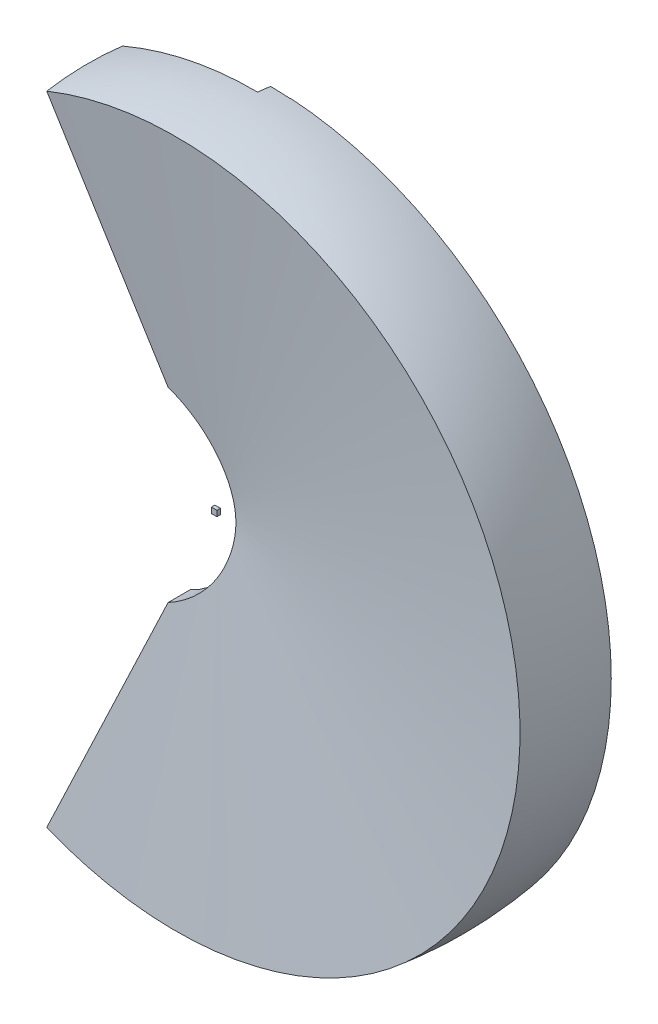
ISO-10303-21;
HEADER;
FILE_DESCRIPTION(('STEP AP214'),'2;1');
FILE_NAME('part.step','',(''),(''),'','','');
FILE_SCHEMA(('AUTOMOTIVE_DESIGN { 1 0 10303 214 1 1 1 1 }'));
ENDSEC;
DATA;
#1=APPLICATION_CONTEXT('core data for automotive mechanical design processes');
#2=APPLICATION_PROTOCOL_DEFINITION('international standard','automotive_design',2000,#1);
#3=PRODUCT_CONTEXT('',#1,'mechanical');
#4=PRODUCT('Part','Part','',(#3));
#5=PRODUCT_RELATED_PRODUCT_CATEGORY('part','',(#4));
#6=PRODUCT_DEFINITION_FORMATION('','',#4);
#7=PRODUCT_DEFINITION_CONTEXT('part definition',#1,'design');
#8=PRODUCT_DEFINITION('design','',#6,#7);
#9=PRODUCT_DEFINITION_SHAPE('','',#8);
#10=(LENGTH_UNIT() NAMED_UNIT(*) SI_UNIT(.MILLI.,.METRE.));
#11=(NAMED_UNIT(*) PLANE_ANGLE_UNIT() SI_UNIT($,.RADIAN.));
#12=(NAMED_UNIT(*) SI_UNIT($,.STERADIAN.) SOLID_ANGLE_UNIT());
#13=UNCERTAINTY_MEASURE_WITH_UNIT(LENGTH_MEASURE(1.E-05),#10,'distance_accuracy_value','');
#14=(GEOMETRIC_REPRESENTATION_CONTEXT(3) GLOBAL_UNCERTAINTY_ASSIGNED_CONTEXT((#13)) GLOBAL_UNIT_ASSIGNED_CONTEXT((#10,
#11,#12)) REPRESENTATION_CONTEXT('',''));
#15=CARTESIAN_POINT('',(0.,0.,0.));
#16=DIRECTION('',(0.,0.,1.));
#17=DIRECTION('',(1.,0.,0.));
#18=AXIS2_PLACEMENT_3D('',#15,#16,#17);
#19=CARTESIAN_POINT('',(0.,0.,-7.5));
#20=DIRECTION('',(0.,0.,1.));
#21=DIRECTION('',(1.,0.,0.));
#22=AXIS2_PLACEMENT_3D('',#19,#20,#21);
#23=SPHERICAL_SURFACE('',#22,4000.);
#24=CARTESIAN_POINT('',(0.,0.,-7.5));
#25=DIRECTION('',(0.997893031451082,-0.0648806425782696,0.));
#26=DIRECTION('',(0.0648806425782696,0.997893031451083,0.));
#27=AXIS2_PLACEMENT_3D('',#24,#25,#26);
#28=CIRCLE('',#27,4000.);
#29=CARTESIAN_POINT('',(256.858744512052,3950.60130464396,-579.140548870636));
#30=VERTEX_POINT('',#29);
#31=CARTESIAN_POINT('',(256.800723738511,3949.70891943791,-585.300000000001));
#32=VERTEX_POINT('',#31);
#33=EDGE_CURVE('E145',#30,#32,#28,.F.);
#34=ORIENTED_EDGE('',*,*,#33,.F.);
#35=CARTESIAN_POINT('',(-1.96086942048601E-12,0.,-579.140548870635));
#36=DIRECTION('',(0.,0.,1.));
#37=DIRECTION('',(1.,0.,0.));
#38=AXIS2_PLACEMENT_3D('',#35,#36,#37);
#39=CIRCLE('',#38,3958.94267234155);
#40=CARTESIAN_POINT('',(32.4999999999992,3958.80926957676,-579.140548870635));
#41=VERTEX_POINT('',#40);
#42=EDGE_CURVE('E182',#30,#41,#39,.T.);
#43=ORIENTED_EDGE('',*,*,#42,.T.);
#44=CARTESIAN_POINT('',(32.5,0.,-7.5));
#45=DIRECTION('',(-1.,0.,0.));
#46=DIRECTION('',(0.,-1.,0.));
#47=AXIS2_PLACEMENT_3D('',#44,#45,#46);
#48=CIRCLE('',#47,3999.8679665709);
#49=CARTESIAN_POINT('',(32.4999999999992,3977.58430490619,-429.124059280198));
#50=VERTEX_POINT('',#49);
#51=EDGE_CURVE('E304',#50,#41,#48,.T.);
#52=ORIENTED_EDGE('',*,*,#51,.F.);
#53=CARTESIAN_POINT('',(0.,-1.28889548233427E-05,-7.50012159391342));
#54=DIRECTION('',(0.,0.105409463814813,0.994428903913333));
#55=DIRECTION('',(0.,-0.994428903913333,0.105409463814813));
#56=AXIS2_PLACEMENT_3D('',#53,#54,#55);
#57=CIRCLE('',#56,4000.);
#58=CARTESIAN_POINT('',(-1495.43439657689,3689.27439106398,-398.563208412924));
#59=VERTEX_POINT('',#58);
#60=EDGE_CURVE('E325',#50,#59,#57,.T.);
#61=ORIENTED_EDGE('',*,*,#60,.T.);
#62=CARTESIAN_POINT('',(0.,0.,-7.5));
#63=DIRECTION('',(0.926758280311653,0.375658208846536,0.));
#64=DIRECTION('',(-0.375658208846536,0.926758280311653,0.));
#65=AXIS2_PLACEMENT_3D('',#62,#63,#64);
#66=CIRCLE('',#65,4000.);
#67=CARTESIAN_POINT('',(-1491.43243809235,3679.4014585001,479.977373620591));
#68=VERTEX_POINT('',#67);
#69=EDGE_CURVE('E172',#68,#59,#66,.F.);
#70=ORIENTED_EDGE('',*,*,#69,.F.);
#71=CARTESIAN_POINT('',(1.67216877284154E-12,0.,479.977373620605));
#72=DIRECTION('',(0.,0.,1.));
#73=DIRECTION('',(1.,0.,0.));
#74=AXIS2_PLACEMENT_3D('',#71,#72,#73);
#75=CIRCLE('',#74,3970.18460656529);
#76=CARTESIAN_POINT('',(-1491.43243809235,-3679.4014585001,479.977373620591));
#77=VERTEX_POINT('',#76);
#78=EDGE_CURVE('E167',#77,#68,#75,.T.);
#79=ORIENTED_EDGE('',*,*,#78,.F.);
#80=CARTESIAN_POINT('',(0.,0.,-7.5));
#81=DIRECTION('',(-0.926758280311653,0.375658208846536,0.));
#82=DIRECTION('',(-0.375658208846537,-0.926758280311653,0.));
#83=AXIS2_PLACEMENT_3D('',#80,#81,#82);
#84=CIRCLE('',#83,4000.);
#85=CARTESIAN_POINT('',(-1495.43440107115,-3689.27440215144,-398.563086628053));
#86=VERTEX_POINT('',#85);
#87=EDGE_CURVE('E310',#77,#86,#84,.F.);
#88=ORIENTED_EDGE('',*,*,#87,.T.);
#89=CARTESIAN_POINT('',(0.,0.,-7.50000000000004));
#90=DIRECTION('',(0.,-0.105409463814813,0.994428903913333));
#91=DIRECTION('',(0.,-0.994428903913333,-0.105409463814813));
#92=AXIS2_PLACEMENT_3D('',#89,#90,#91);
#93=CIRCLE('',#92,4000.);
#94=CARTESIAN_POINT('',(32.5000000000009,-3977.58431779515,-429.123937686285));
#95=VERTEX_POINT('',#94);
#96=EDGE_CURVE('E318',#86,#95,#93,.T.);
#97=ORIENTED_EDGE('',*,*,#96,.T.);
#98=CARTESIAN_POINT('',(32.5,0.,-7.5));
#99=DIRECTION('',(-1.,0.,0.));
#100=DIRECTION('',(0.,-1.,0.));
#101=AXIS2_PLACEMENT_3D('',#98,#99,#100);
#102=CIRCLE('',#101,3999.8679665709);
#103=CARTESIAN_POINT('',(32.5000000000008,-3958.80926957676,-579.140548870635));
#104=VERTEX_POINT('',#103);
#105=EDGE_CURVE('E323',#104,#95,#102,.T.);
#106=ORIENTED_EDGE('',*,*,#105,.F.);
#107=CARTESIAN_POINT('',(-1.96086942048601E-12,0.,-579.140548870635));
#108=DIRECTION('',(0.,0.,1.));
#109=DIRECTION('',(1.,0.,0.));
#110=AXIS2_PLACEMENT_3D('',#107,#108,#109);
#111=CIRCLE('',#110,3958.94267234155);
#112=CARTESIAN_POINT('',(256.858744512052,-3950.60130464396,-579.140548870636));
#113=VERTEX_POINT('',#112);
#114=EDGE_CURVE('E258',#104,#113,#111,.T.);
#115=ORIENTED_EDGE('',*,*,#114,.T.);
#116=CARTESIAN_POINT('',(0.,0.,-7.5));
#117=DIRECTION('',(0.997893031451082,0.0648806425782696,0.));
#118=DIRECTION('',(-0.0648806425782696,0.997893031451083,0.));
#119=AXIS2_PLACEMENT_3D('',#116,#117,#118);
#120=CIRCLE('',#119,4000.);
#121=CARTESIAN_POINT('',(256.800723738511,-3949.70891943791,-585.300000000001));
#122=VERTEX_POINT('',#121);
#123=EDGE_CURVE('E166',#122,#113,#120,.F.);
#124=ORIENTED_EDGE('',*,*,#123,.F.);
#125=CARTESIAN_POINT('',(-1.98199787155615E-12,0.,-585.299999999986));
#126=DIRECTION('',(0.,0.,1.));
#127=DIRECTION('',(1.,0.,0.));
#128=AXIS2_PLACEMENT_3D('',#125,#126,#127);
#129=CIRCLE('',#128,3958.04840293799);
#130=EDGE_CURVE('E159',#122,#32,#129,.T.);
#131=ORIENTED_EDGE('',*,*,#130,.T.);
#132=EDGE_LOOP('',(#34,#43,#52,#61,#70,#79,#88,#97,#106,#115,#124,#131));
#133=FACE_BOUND('',#132,.T.);
#134=ADVANCED_FACE('F46',(#133),#23,.T.);
#135=CARTESIAN_POINT('',(32.5,0.,0.));
#136=DIRECTION('',(-1.,0.,0.));
#137=DIRECTION('',(0.,-1.,0.));
#138=AXIS2_PLACEMENT_3D('',#135,#136,#137);
#139=PLANE('',#138);
#140=ORIENTED_EDGE('',*,*,#51,.T.);
#141=CARTESIAN_POINT('',(32.4999999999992,3977.58500490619,-581.95720431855));
#142=CARTESIAN_POINT('',(32.4999999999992,3894.73332832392,-569.528149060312));
#143=CARTESIAN_POINT('',(32.4999999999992,3811.88164810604,-557.099118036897));
#144=CARTESIAN_POINT('',(32.4999999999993,3646.17827953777,-532.241117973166));
#145=CARTESIAN_POINT('',(32.4999999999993,3563.32659118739,-519.812148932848));
#146=CARTESIAN_POINT('',(32.4999999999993,3397.62326066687,-494.954294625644));
#147=CARTESIAN_POINT('',(32.4999999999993,3314.77161849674,-482.525409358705));
#148=CARTESIAN_POINT('',(32.4999999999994,3149.06831891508,-457.66773265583));
#149=CARTESIAN_POINT('',(32.4999999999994,3066.21666150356,-445.238941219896));
#150=CARTESIAN_POINT('',(32.4999999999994,2900.51344388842,-420.381494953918));
#151=CARTESIAN_POINT('',(32.4999999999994,2817.66188368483,-407.952840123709));
#152=CARTESIAN_POINT('',(32.4999999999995,2651.95874349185,-383.095685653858));
#153=CARTESIAN_POINT('',(32.4999999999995,2569.10716350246,-370.66718601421));
#154=CARTESIAN_POINT('',(32.4999999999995,2403.40391990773,-345.810384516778));
#155=CARTESIAN_POINT('',(32.4999999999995,2320.55225630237,-333.382082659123));
#156=CARTESIAN_POINT('',(32.4999999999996,2154.84887446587,-308.525757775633));
#157=CARTESIAN_POINT('',(32.4999999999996,2071.99715623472,-296.097734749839));
#158=CARTESIAN_POINT('',(32.4999999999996,1947.71943461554,-277.455986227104));
#159=CARTESIAN_POINT('',(32.4999999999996,1906.29345379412,-271.24211028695));
#160=CARTESIAN_POINT('',(32.4999999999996,1823.4414742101,-258.814481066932));
#161=CARTESIAN_POINT('',(32.4999999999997,1782.01547544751,-252.600727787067));
#162=CARTESIAN_POINT('',(32.4999999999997,1699.16347925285,-240.173375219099));
#163=CARTESIAN_POINT('',(32.4999999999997,1657.73748182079,-233.95977593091));
#164=CARTESIAN_POINT('',(32.4999999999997,1574.88545712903,-221.53276483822));
#165=CARTESIAN_POINT('',(32.4999999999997,1533.45942986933,-215.319353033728));
#166=CARTESIAN_POINT('',(32.4999999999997,1450.60745405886,-202.89278499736));
#167=CARTESIAN_POINT('',(32.4999999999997,1409.18150550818,-196.679628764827));
#168=CARTESIAN_POINT('',(32.4999999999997,1326.32956829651,-184.253626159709));
#169=CARTESIAN_POINT('',(32.4999999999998,1284.90357963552,-178.040779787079));
#170=CARTESIAN_POINT('',(32.4999999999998,1202.05146274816,-165.615486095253));
#171=CARTESIAN_POINT('',(32.4999999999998,1160.62533452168,-159.403038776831));
#172=CARTESIAN_POINT('',(32.4999999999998,1077.77297085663,-146.978701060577));
#173=CARTESIAN_POINT('',(32.4999999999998,1036.34673541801,-140.766810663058));
#174=CARTESIAN_POINT('',(32.4999999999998,974.207121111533,-131.449549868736));
#175=CARTESIAN_POINT('',(32.4999999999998,953.493787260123,-128.343879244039));
#176=CARTESIAN_POINT('',(32.4999999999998,912.067083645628,-122.132782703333));
#177=CARTESIAN_POINT('',(32.4999999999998,891.353713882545,-119.027356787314));
#178=CARTESIAN_POINT('',(32.4999999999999,849.926973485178,-112.816811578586));
#179=CARTESIAN_POINT('',(32.4999999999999,829.213602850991,-109.711692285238));
#180=CARTESIAN_POINT('',(32.4999999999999,787.786802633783,-103.501827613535));
#181=CARTESIAN_POINT('',(32.4999999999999,767.073373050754,-100.397082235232));
#182=CARTESIAN_POINT('',(32.4999999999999,725.646655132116,-94.1880985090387));
#183=CARTESIAN_POINT('',(32.4999999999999,704.933366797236,-91.0838601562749));
#184=CARTESIAN_POINT('',(32.4999999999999,663.506708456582,-84.8760004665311));
#185=CARTESIAN_POINT('',(32.4999999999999,642.793338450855,-81.7723791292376));
#186=CARTESIAN_POINT('',(32.4999999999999,601.366331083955,-75.5659324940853));
#187=CARTESIAN_POINT('',(32.4999999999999,580.652693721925,-72.4631072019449));
#188=CARTESIAN_POINT('',(32.4999999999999,539.22521278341,-66.2585655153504));
#189=CARTESIAN_POINT('',(32.4999999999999,518.511369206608,-63.1568491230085));
#190=CARTESIAN_POINT('',(32.4999999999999,487.440118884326,-58.5054217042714));
#191=CARTESIAN_POINT('',(32.4999999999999,477.082801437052,-56.9551141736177));
#192=CARTESIAN_POINT('',(32.4999999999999,456.368094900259,-53.8549848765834));
#193=CARTESIAN_POINT('',(32.4999999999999,446.010705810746,-52.3051631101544));
#194=CARTESIAN_POINT('',(32.4999999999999,425.295912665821,-49.2061257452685));
#195=CARTESIAN_POINT('',(32.4999999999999,414.938508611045,-47.6569101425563));
#196=CARTESIAN_POINT('',(32.4999999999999,394.223585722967,-44.5592200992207));
#197=CARTESIAN_POINT('',(32.4999999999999,383.866066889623,-43.0107456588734));
#198=CARTESIAN_POINT('',(32.4999999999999,363.151266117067,-39.9147932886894));
#199=CARTESIAN_POINT('',(32.5,352.793984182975,-38.367315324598));
#200=CARTESIAN_POINT('',(32.5,332.079253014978,-35.2735775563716));
#201=CARTESIAN_POINT('',(32.5,321.721803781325,-33.7273177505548));
#202=CARTESIAN_POINT('',(32.5,301.006418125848,-30.6363710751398));
#203=CARTESIAN_POINT('',(32.5,290.648481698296,-29.0916842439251));
#204=CARTESIAN_POINT('',(32.5,269.932228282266,-26.0044995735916));
#205=CARTESIAN_POINT('',(32.5,259.573911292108,-24.4620017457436));
#206=CARTESIAN_POINT('',(32.5,238.855637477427,-21.3799196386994));
#207=CARTESIAN_POINT('',(32.5,228.495680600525,-19.8403357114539));
#208=CARTESIAN_POINT('',(32.5,212.955332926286,-17.5344215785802));
#209=CARTESIAN_POINT('',(32.5,207.775197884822,-16.7663678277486));
#210=CARTESIAN_POINT('',(32.5,197.414711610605,-15.2316993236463));
#211=CARTESIAN_POINT('',(32.5,192.234360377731,-14.4650845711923));
#212=CARTESIAN_POINT('',(32.5,181.873973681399,-12.9337532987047));
#213=CARTESIAN_POINT('',(32.5,176.693938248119,-12.1690365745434));
#214=CARTESIAN_POINT('',(32.5,166.333534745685,-10.6419344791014));
#215=CARTESIAN_POINT('',(32.5,161.153166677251,-9.87954910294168));
#216=CARTESIAN_POINT('',(32.5,150.791640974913,-8.3577879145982));
#217=CARTESIAN_POINT('',(32.5,145.610483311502,-7.59841230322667));
#218=CARTESIAN_POINT('',(32.5,135.247523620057,-6.08378599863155));
#219=CARTESIAN_POINT('',(32.5,130.065721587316,-5.32853533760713));
#220=CARTESIAN_POINT('',(32.5,119.69927993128,-3.82347172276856));
#221=CARTESIAN_POINT('',(32.5,114.51463998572,-3.07366098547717));
#222=CARTESIAN_POINT('',(32.5,106.736852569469,-1.95521531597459));
#223=CARTESIAN_POINT('',(32.5,104.144155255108,-1.58345034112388));
#224=CARTESIAN_POINT('',(32.5,98.9583927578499,-0.84249583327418));
#225=CARTESIAN_POINT('',(32.5,96.3653275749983,-0.473306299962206));
#226=CARTESIAN_POINT('',(32.5,91.1794055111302,0.261791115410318));
#227=CARTESIAN_POINT('',(32.5,88.5865487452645,0.627699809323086));
#228=CARTESIAN_POINT('',(32.5,83.4002738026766,1.35550615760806));
#229=CARTESIAN_POINT('',(32.5,80.806855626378,1.71740381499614));
#230=CARTESIAN_POINT('',(32.5,75.6190403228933,2.43610701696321));
#231=CARTESIAN_POINT('',(32.5,73.0246431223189,2.79291203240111));
#232=CARTESIAN_POINT('',(32.5,67.8349287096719,3.49984398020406));
#233=CARTESIAN_POINT('',(32.5,65.239611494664,3.84997089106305));
#234=CARTESIAN_POINT('',(32.5,60.045475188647,4.54165479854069));
#235=CARTESIAN_POINT('',(32.5,57.4466550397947,4.88320386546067));
#236=CARTESIAN_POINT('',(32.5,52.2474764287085,5.55424505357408));
#237=CARTESIAN_POINT('',(32.5,49.6471179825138,5.88373729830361));
#238=CARTESIAN_POINT('',(32.5,45.7454237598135,6.36531300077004));
#239=CARTESIAN_POINT('',(32.5,44.4448666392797,6.52370437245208));
#240=CARTESIAN_POINT('',(32.5,41.8431490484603,6.83546416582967));
#241=CARTESIAN_POINT('',(32.5,40.5419885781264,6.988832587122));
#242=CARTESIAN_POINT('',(32.5,37.9389112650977,7.28958856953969));
#243=CARTESIAN_POINT('',(32.5,36.6369943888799,7.43697584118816));
#244=CARTESIAN_POINT('',(32.5,34.0323650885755,7.72457245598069));
#245=CARTESIAN_POINT('',(32.5,32.7296526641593,7.86478179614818));
#246=CARTESIAN_POINT('',(32.5,30.1218257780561,8.1367381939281));
#247=CARTESIAN_POINT('',(32.5,28.8167102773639,8.26847532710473));
#248=CARTESIAN_POINT('',(32.5,26.2054693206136,8.52157645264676));
#249=CARTESIAN_POINT('',(32.5,24.8993438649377,8.64294044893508));
#250=CARTESIAN_POINT('',(32.5,22.2861663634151,8.87324209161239));
#251=CARTESIAN_POINT('',(32.5,20.9791144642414,8.98218139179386));
#252=CARTESIAN_POINT('',(32.5,18.3638538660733,9.18534002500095));
#253=CARTESIAN_POINT('',(32.5,17.0556451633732,9.2795593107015));
#254=CARTESIAN_POINT('',(32.5,14.4366806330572,9.45087180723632));
#255=CARTESIAN_POINT('',(32.5,13.1259235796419,9.52794646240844));
#256=CARTESIAN_POINT('',(32.5,10.5034102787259,9.66236629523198));
#257=CARTESIAN_POINT('',(32.5,9.19165404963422,9.71971182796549));
#258=CARTESIAN_POINT('',(32.5,6.56672457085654,9.81246858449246));
#259=CARTESIAN_POINT('',(32.5,5.25355094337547,9.84786928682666));
#260=CARTESIAN_POINT('',(32.5,2.62669248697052,9.89538957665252));
#261=CARTESIAN_POINT('',(32.5,1.31300762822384,9.90750750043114));
#262=CARTESIAN_POINT('',(32.5,-0.000699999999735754,9.90732959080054));
#263=B_SPLINE_CURVE_WITH_KNOTS('',3,(#141,#142,#143,#144,#145,#146,#147,#148,#149,#150,#151,
#152,#153,#154,#155,#156,#157,#158,#159,#160,#161,#162,#163,#164,#165,#166,#167,#168,#169,#170,
#171,#172,#173,#174,#175,#176,#177,#178,#179,#180,#181,#182,#183,#184,#185,#186,#187,#188,#189,
#190,#191,#192,#193,#194,#195,#196,#197,#198,#199,#200,#201,#202,#203,#204,#205,#206,#207,#208,
#209,#210,#211,#212,#213,#214,#215,#216,#217,#218,#219,#220,#221,#222,#223,#224,#225,#226,#227,
#228,#229,#230,#231,#232,#233,#234,#235,#236,#237,#238,#239,#240,#241,#242,#243,#244,#245,#246,
#247,#248,#249,#250,#251,#252,#253,#254,#255,#256,#257,#258,#259,#260,#261,#262),.UNSPECIFIED.,
.F.,.F.,(4,2,2,2,2,2,2,2,2,2,2,2,2,2,2,2,2,2,2,2,2,2,2,2,2,2,2,2,2,2,2,2,2,2,2,2,2,2,2,2,2,2,2,
2,2,2,2,2,2,2,2,2,2,2,2,2,2,2,2,2,4),(0.,251.336299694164,502.672595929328,754.008717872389,
1005.34484327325,1256.68061948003,1508.01638531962,1759.35231120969,2010.6882750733,
2136.35655775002,2262.02483906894,2387.69304791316,2513.36126182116,2639.0291284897,
2764.69697628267,2890.36506058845,3016.03321519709,3078.86781158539,3141.70240566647,
3204.5368659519,3267.37133483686,3330.20515919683,3393.0389515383,3455.87318325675,
3518.70753402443,3550.12563872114,3581.54374027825,3612.96161716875,3644.37950575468,
3675.79624954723,3707.21294989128,3738.63039932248,3770.04800993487,3801.46919984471,
3817.17949410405,3832.88979727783,3848.59833050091,3864.30683082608,3880.01636215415,
3895.72601593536,3911.44174678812,3919.29939157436,3927.15703540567,3935.01267798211,
3942.86831465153,3950.7247616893,3958.58123402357,3966.44472010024,3974.30812558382,
3978.23861789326,3982.16911051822,3986.09979314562,3990.030477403,3993.96568525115,
3997.90089161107,4001.83557356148,4005.7702681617,4009.70920078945,4013.64806252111,
4017.5888112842,4021.52984163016),.UNSPECIFIED.);
#264=CARTESIAN_POINT('',(32.4999999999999,663.324958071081,-84.848876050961));
#265=VERTEX_POINT('',#264);
#266=EDGE_CURVE('E152',#41,#265,#263,.T.);
#267=ORIENTED_EDGE('',*,*,#266,.T.);
#268=DIRECTION('',(0.,0.,-1.));
#269=VECTOR('',#268,1.);
#270=CARTESIAN_POINT('',(32.4999999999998,663.324958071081,479.978373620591));
#271=LINE('',#270,#269);
#272=CARTESIAN_POINT('',(32.4999999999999,663.324958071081,-77.8125685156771));
#273=VERTEX_POINT('',#272);
#274=EDGE_CURVE('E297',#265,#273,#271,.F.);
#275=ORIENTED_EDGE('',*,*,#274,.T.);
#276=DIRECTION('',(0.,-0.994428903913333,0.105409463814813));
#277=VECTOR('',#276,1.);
#278=CARTESIAN_POINT('',(32.4999999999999,499.998839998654,-60.4999999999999));
#279=LINE('',#278,#277);
#280=EDGE_CURVE('E307',#50,#273,#279,.T.);
#281=ORIENTED_EDGE('',*,*,#280,.F.);
#282=EDGE_LOOP('',(#140,#267,#275,#281));
#283=FACE_BOUND('',#282,.T.);
#284=ADVANCED_FACE('F220',(#283),#139,.T.);
#285=CARTESIAN_POINT('',(-967.5,0.,479.978373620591));
#286=DIRECTION('',(0.,0.,-1.));
#287=DIRECTION('',(-1.,0.,0.));
#288=AXIS2_PLACEMENT_3D('',#285,#286,#287);
#289=CYLINDRICAL_SURFACE('',#288,1200.);
#290=CARTESIAN_POINT('',(123.841126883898,498.973491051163,-62.3444673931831));
#291=CARTESIAN_POINT('',(121.71529335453,503.62305501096,-62.9446397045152));
#292=CARTESIAN_POINT('',(119.559836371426,508.258836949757,-63.5461636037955));
#293=CARTESIAN_POINT('',(115.189979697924,517.502214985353,-64.7516652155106));
#294=CARTESIAN_POINT('',(112.975580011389,522.109811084,-65.3556429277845));
#295=CARTESIAN_POINT('',(106.244518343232,535.889193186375,-67.1708570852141));
#296=CARTESIAN_POINT('',(101.639903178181,545.017771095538,-68.3854001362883));
#297=CARTESIAN_POINT('',(92.2114437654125,563.130207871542,-70.8182887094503));
#298=CARTESIAN_POINT('',(87.3881913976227,572.114377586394,-72.0366165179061));
#299=CARTESIAN_POINT('',(77.5145791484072,589.956340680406,-74.4786218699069));
#300=CARTESIAN_POINT('',(72.4642193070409,598.814134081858,-75.7022994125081));
#301=CARTESIAN_POINT('',(62.1396576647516,616.397696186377,-78.1536419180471));
#302=CARTESIAN_POINT('',(56.8654563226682,625.123465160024,-79.3813068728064));
#303=CARTESIAN_POINT('',(46.0965775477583,642.437479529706,-81.8394439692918));
#304=CARTESIAN_POINT('',(40.6019000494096,651.025724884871,-83.069916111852));
#305=CARTESIAN_POINT('',(29.3811886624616,668.081099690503,-85.5357781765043));
#306=CARTESIAN_POINT('',(23.6545967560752,676.54786137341,-86.7711726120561));
#307=CARTESIAN_POINT('',(11.9870449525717,693.332250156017,-89.2428098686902));
#308=CARTESIAN_POINT('',(6.04608493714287,701.649877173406,-90.4790526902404));
#309=CARTESIAN_POINT('',(-0.00020000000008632,709.890228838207,-91.7152612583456));
#310=B_SPLINE_CURVE_WITH_KNOTS('',3,(#290,#291,#292,#293,#294,#295,#296,#297,#298,#299,#300,
#301,#302,#303,#304,#305,#306,#307,#308,#309),.UNSPECIFIED.,.F.,.F.,(4,2,2,2,2,2,2,2,2,4),(0.,
15.4425917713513,30.8851825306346,61.7697062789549,92.5751050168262,123.380498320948,
154.185828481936,184.991167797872,215.875634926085,246.760119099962),.UNSPECIFIED.);
#311=CARTESIAN_POINT('',(42.165140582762,648.518545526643,-82.7136576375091));
#312=VERTEX_POINT('',#311);
#313=EDGE_CURVE('E12',#312,#265,#310,.T.);
#314=ORIENTED_EDGE('',*,*,#313,.F.);
#315=DIRECTION('',(0.,0.,-1.));
#316=VECTOR('',#315,1.);
#317=CARTESIAN_POINT('',(42.165140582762,648.518545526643,479.978373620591));
#318=LINE('',#317,#316);
#319=CARTESIAN_POINT('',(42.1651405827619,648.518545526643,-585.3));
#320=VERTEX_POINT('',#319);
#321=EDGE_CURVE('E60',#312,#320,#318,.T.);
#322=ORIENTED_EDGE('',*,*,#321,.T.);
#323=CARTESIAN_POINT('',(-967.5,0.,-585.3));
#324=DIRECTION('',(0.,0.,-1.));
#325=DIRECTION('',(-1.,0.,0.));
#326=AXIS2_PLACEMENT_3D('',#323,#324,#325);
#327=CIRCLE('',#326,1200.);
#328=CARTESIAN_POINT('',(155.120187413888,423.938574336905,-585.3));
#329=VERTEX_POINT('',#328);
#330=EDGE_CURVE('E161',#320,#329,#327,.T.);
#331=ORIENTED_EDGE('',*,*,#330,.T.);
#332=CARTESIAN_POINT('',(155.1201145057,-423.938767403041,-585.3002));
#333=CARTESIAN_POINT('',(156.270016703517,-420.8937353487,-582.145823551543));
#334=CARTESIAN_POINT('',(157.408970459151,-417.840227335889,-578.995635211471));
#335=CARTESIAN_POINT('',(159.664909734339,-411.715821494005,-572.704295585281));
#336=CARTESIAN_POINT('',(160.781895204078,-408.64492362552,-569.563144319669));
#337=CARTESIAN_POINT('',(162.993846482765,-402.485243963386,-563.290482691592));
#338=CARTESIAN_POINT('',(164.088811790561,-399.396461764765,-560.15897254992));
#339=CARTESIAN_POINT('',(166.256612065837,-393.200605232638,-553.906426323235));
#340=CARTESIAN_POINT('',(167.329447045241,-390.093530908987,-550.785390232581));
#341=CARTESIAN_POINT('',(170.516344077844,-380.739064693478,-541.434145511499));
#342=CARTESIAN_POINT('',(172.597035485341,-374.463335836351,-535.220800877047));
#343=CARTESIAN_POINT('',(175.650743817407,-364.989565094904,-525.940203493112));
#344=CARTESIAN_POINT('',(176.657427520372,-361.821604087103,-522.853233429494));
#345=CARTESIAN_POINT('',(178.648252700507,-355.464873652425,-516.693487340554));
#346=CARTESIAN_POINT('',(179.632394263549,-352.276104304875,-513.620711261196));
#347=CARTESIAN_POINT('',(181.620353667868,-345.737748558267,-507.357128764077));
#348=CARTESIAN_POINT('',(182.623164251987,-342.387202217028,-504.167004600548));
#349=CARTESIAN_POINT('',(184.603975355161,-335.661614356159,-497.804917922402));
#350=CARTESIAN_POINT('',(185.58197586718,-332.286572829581,-494.632955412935));
#351=CARTESIAN_POINT('',(187.513016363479,-325.510893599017,-488.308786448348));
#352=CARTESIAN_POINT('',(188.466056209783,-322.110255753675,-485.156580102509));
#353=CARTESIAN_POINT('',(190.346998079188,-315.282205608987,-478.87373135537));
#354=CARTESIAN_POINT('',(191.274900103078,-311.85479331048,-475.743088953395));
#355=CARTESIAN_POINT('',(193.104958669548,-304.973441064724,-469.506783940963));
#356=CARTESIAN_POINT('',(194.007126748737,-301.519513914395,-466.401110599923));
#357=CARTESIAN_POINT('',(195.785944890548,-294.582133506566,-460.215527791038));
#358=CARTESIAN_POINT('',(196.66259495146,-291.098680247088,-457.135618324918));
#359=CARTESIAN_POINT('',(198.390138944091,-284.100639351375,-451.004057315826));
#360=CARTESIAN_POINT('',(199.241032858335,-280.586051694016,-447.952405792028));
#361=CARTESIAN_POINT('',(200.916794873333,-273.523973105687,-441.880168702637));
#362=CARTESIAN_POINT('',(201.741662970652,-269.97648217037,-438.859583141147));
#363=CARTESIAN_POINT('',(203.366947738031,-262.838392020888,-432.845688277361));
#364=CARTESIAN_POINT('',(204.167303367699,-259.247712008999,-429.852458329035));
#365=CARTESIAN_POINT('',(205.741211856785,-252.029175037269,-423.903992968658));
#366=CARTESIAN_POINT('',(206.514764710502,-248.401318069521,-420.948757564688));
#367=CARTESIAN_POINT('',(208.034689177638,-241.105948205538,-415.080289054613));
#368=CARTESIAN_POINT('',(208.781060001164,-237.438434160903,-412.16705717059));
#369=CARTESIAN_POINT('',(210.246136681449,-230.061252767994,-406.387342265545));
#370=CARTESIAN_POINT('',(210.964842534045,-226.351585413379,-403.520859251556));
#371=CARTESIAN_POINT('',(212.375271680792,-218.880832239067,-397.835069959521));
#372=CARTESIAN_POINT('',(213.066946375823,-215.119668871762,-395.015853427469));
#373=CARTESIAN_POINT('',(214.421385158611,-207.549094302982,-389.435786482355));
#374=CARTESIAN_POINT('',(215.084149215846,-203.739683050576,-386.674936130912));
#375=CARTESIAN_POINT('',(216.380028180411,-196.069392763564,-381.218711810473));
#376=CARTESIAN_POINT('',(217.01314397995,-192.208515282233,-378.523335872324));
#377=CARTESIAN_POINT('',(218.248910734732,-184.431620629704,-373.206051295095));
#378=CARTESIAN_POINT('',(218.851561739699,-180.515603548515,-370.58414253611));
#379=CARTESIAN_POINT('',(220.015157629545,-172.693687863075,-365.468220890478));
#380=CARTESIAN_POINT('',(220.576647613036,-168.788810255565,-362.972773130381));
#381=CARTESIAN_POINT('',(221.66820209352,-160.91852139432,-358.071886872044));
#382=CARTESIAN_POINT('',(222.198266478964,-156.953109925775,-355.666448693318));
#383=CARTESIAN_POINT('',(223.22585985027,-148.956972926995,-350.95653642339));
#384=CARTESIAN_POINT('',(223.72337962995,-144.926229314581,-348.652090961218));
#385=CARTESIAN_POINT('',(224.684264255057,-136.797044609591,-344.158180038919));
#386=CARTESIAN_POINT('',(225.147629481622,-132.698604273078,-341.968713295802));
#387=CARTESIAN_POINT('',(226.037118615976,-124.44405676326,-337.726585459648));
#388=CARTESIAN_POINT('',(226.463356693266,-120.288175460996,-335.673509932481));
#389=CARTESIAN_POINT('',(227.278376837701,-111.903405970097,-331.713243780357));
#390=CARTESIAN_POINT('',(227.66715722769,-107.674514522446,-329.806059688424));
#391=CARTESIAN_POINT('',(228.404873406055,-99.1455626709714,-326.15753011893));
#392=CARTESIAN_POINT('',(228.753836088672,-94.8455525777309,-324.416072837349));
#393=CARTESIAN_POINT('',(229.409853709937,-86.1725510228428,-321.117940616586));
#394=CARTESIAN_POINT('',(229.716915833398,-81.7995722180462,-319.561234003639));
#395=CARTESIAN_POINT('',(230.228124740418,-73.8894688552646,-316.952574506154));
#396=CARTESIAN_POINT('',(230.440450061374,-70.3653824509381,-315.86265371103));
#397=CARTESIAN_POINT('',(230.835868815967,-63.2751936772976,-313.823429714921));
#398=CARTESIAN_POINT('',(231.01896402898,-59.7090938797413,-312.874117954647));
#399=CARTESIAN_POINT('',(231.354710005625,-52.5382537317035,-311.126470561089));
#400=CARTESIAN_POINT('',(231.507358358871,-48.9335103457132,-310.328146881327));
#401=CARTESIAN_POINT('',(231.781039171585,-41.6907814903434,-308.892295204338));
#402=CARTESIAN_POINT('',(231.902071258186,-38.0527956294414,-308.254769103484));
#403=CARTESIAN_POINT('',(232.111136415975,-30.7631151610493,-307.150947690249));
#404=CARTESIAN_POINT('',(232.199285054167,-27.1115150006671,-306.68405282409));
#405=CARTESIAN_POINT('',(232.342399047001,-19.7895112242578,-305.924906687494));
#406=CARTESIAN_POINT('',(232.397364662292,-16.1191077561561,-305.63265404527));
#407=CARTESIAN_POINT('',(232.473594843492,-8.76819264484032,-305.227105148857));
#408=CARTESIAN_POINT('',(232.494860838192,-5.08768143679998,-305.113801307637));
#409=CARTESIAN_POINT('',(232.503490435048,2.27451849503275,-305.067839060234));
#410=CARTESIAN_POINT('',(232.490853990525,5.95620722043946,-305.135180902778));
#411=CARTESIAN_POINT('',(232.431797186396,13.3121182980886,-305.449511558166));
#412=CARTESIAN_POINT('',(232.385372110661,16.9863395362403,-305.696525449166));
#413=CARTESIAN_POINT('',(232.259173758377,24.3180607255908,-306.366554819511));
#414=CARTESIAN_POINT('',(232.179400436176,27.9755606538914,-306.789570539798));
#415=CARTESIAN_POINT('',(231.987223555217,35.2661212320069,-307.805593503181));
#416=CARTESIAN_POINT('',(231.874818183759,38.8991805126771,-308.398610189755));
#417=CARTESIAN_POINT('',(231.618328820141,46.1338940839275,-309.746666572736));
#418=CARTESIAN_POINT('',(231.474244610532,49.7355481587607,-310.501707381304));
#419=CARTESIAN_POINT('',(231.154806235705,56.9177911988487,-312.168120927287));
#420=CARTESIAN_POINT('',(230.979316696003,60.4982167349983,-313.080169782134));
#421=CARTESIAN_POINT('',(230.59872970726,67.6176195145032,-315.047891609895));
#422=CARTESIAN_POINT('',(230.39363246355,71.1565970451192,-316.10356358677));
#423=CARTESIAN_POINT('',(229.955078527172,78.1904911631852,-318.347841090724));
#424=CARTESIAN_POINT('',(229.7216202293,81.685405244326,-319.536454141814));
#425=CARTESIAN_POINT('',(229.227609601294,88.6292594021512,-322.035804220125));
#426=CARTESIAN_POINT('',(228.967056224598,92.0781976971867,-323.346545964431));
#427=CARTESIAN_POINT('',(228.236863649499,101.223902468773,-326.99504892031));
#428=CARTESIAN_POINT('',(227.744054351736,106.879248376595,-329.432755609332));
#429=CARTESIAN_POINT('',(226.95462842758,115.26503028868,-333.288659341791));
#430=CARTESIAN_POINT('',(226.683079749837,118.044434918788,-334.607366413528));
#431=CARTESIAN_POINT('',(226.12379402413,123.571652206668,-337.306261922));
#432=CARTESIAN_POINT('',(225.836057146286,126.319465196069,-338.686449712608));
#433=CARTESIAN_POINT('',(225.244735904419,131.786034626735,-341.504438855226));
#434=CARTESIAN_POINT('',(224.9411406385,134.504769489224,-342.942279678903));
#435=CARTESIAN_POINT('',(224.318775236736,139.912164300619,-345.870256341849));
#436=CARTESIAN_POINT('',(224.000005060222,142.600824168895,-347.360392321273));
#437=CARTESIAN_POINT('',(223.347762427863,147.948852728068,-350.388764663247));
#438=CARTESIAN_POINT('',(223.014290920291,150.608223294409,-351.926997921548));
#439=CARTESIAN_POINT('',(222.333035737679,155.898880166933,-355.047904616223));
#440=CARTESIAN_POINT('',(221.985252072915,158.530166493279,-356.63057802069));
#441=CARTESIAN_POINT('',(221.27366976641,163.78101998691,-359.846302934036));
#442=CARTESIAN_POINT('',(220.90978938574,166.400428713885,-361.479594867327));
#443=CARTESIAN_POINT('',(220.168266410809,171.612992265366,-364.784470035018));
#444=CARTESIAN_POINT('',(219.79062381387,174.206147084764,-366.456053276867));
#445=CARTESIAN_POINT('',(219.021887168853,179.367272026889,-369.834589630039));
#446=CARTESIAN_POINT('',(218.630793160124,181.935242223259,-371.541542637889));
#447=CARTESIAN_POINT('',(217.835430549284,187.04707416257,-374.988171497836));
#448=CARTESIAN_POINT('',(217.431161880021,189.590935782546,-376.7278475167));
#449=CARTESIAN_POINT('',(216.609881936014,194.654471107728,-380.236730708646));
#450=CARTESIAN_POINT('',(216.192876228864,197.174154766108,-382.005924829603));
#451=CARTESIAN_POINT('',(215.346185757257,202.19142724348,-385.572359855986));
#452=CARTESIAN_POINT('',(214.916501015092,204.689016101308,-387.369600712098));
#453=CARTESIAN_POINT('',(214.044657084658,209.663060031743,-390.990119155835));
#454=CARTESIAN_POINT('',(213.60249786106,212.139515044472,-392.813396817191));
#455=CARTESIAN_POINT('',(212.705891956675,217.072190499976,-396.484150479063));
#456=CARTESIAN_POINT('',(212.251445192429,219.528410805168,-398.331626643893));
#457=CARTESIAN_POINT('',(210.9120972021,226.644006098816,-403.737598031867));
#458=CARTESIAN_POINT('',(210.011185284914,231.277825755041,-407.325825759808));
#459=CARTESIAN_POINT('',(208.1662603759,240.480490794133,-414.573870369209));
#460=CARTESIAN_POINT('',(207.222246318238,245.049334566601,-418.233689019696));
#461=CARTESIAN_POINT('',(205.291894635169,254.127345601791,-425.616502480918));
#462=CARTESIAN_POINT('',(204.305552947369,258.636507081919,-429.339503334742));
#463=CARTESIAN_POINT('',(202.291364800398,267.599062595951,-436.840860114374));
#464=CARTESIAN_POINT('',(201.263518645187,272.052457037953,-440.619215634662));
#465=CARTESIAN_POINT('',(199.166064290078,280.911070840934,-448.228080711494));
#466=CARTESIAN_POINT('',(198.096422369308,285.316247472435,-452.058630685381));
#467=CARTESIAN_POINT('',(195.91669740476,294.078167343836,-459.763349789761));
#468=CARTESIAN_POINT('',(194.806614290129,298.434910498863,-463.637518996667));
#469=CARTESIAN_POINT('',(192.546518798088,307.102805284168,-471.424532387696));
#470=CARTESIAN_POINT('',(191.396508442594,311.413959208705,-475.33737460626));
#471=CARTESIAN_POINT('',(189.056899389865,319.993608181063,-483.197808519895));
#472=CARTESIAN_POINT('',(187.867300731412,324.26210327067,-487.145400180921));
#473=CARTESIAN_POINT('',(185.487169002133,332.624235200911,-494.946186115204));
#474=CARTESIAN_POINT('',(184.297859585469,336.719127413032,-498.798408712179));
#475=CARTESIAN_POINT('',(181.882718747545,344.873086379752,-506.529216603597));
#476=CARTESIAN_POINT('',(180.656887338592,348.932153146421,-510.407801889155));
#477=CARTESIAN_POINT('',(178.168925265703,357.016245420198,-518.188882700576));
#478=CARTESIAN_POINT('',(176.906793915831,361.041270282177,-522.091378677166));
#479=CARTESIAN_POINT('',(174.346474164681,369.058718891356,-529.917973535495));
#480=CARTESIAN_POINT('',(173.048285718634,373.051142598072,-533.842072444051));
#481=CARTESIAN_POINT('',(170.418733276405,380.996630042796,-541.701867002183));
#482=CARTESIAN_POINT('',(169.087442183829,384.949757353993,-545.637522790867));
#483=CARTESIAN_POINT('',(166.389332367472,392.826056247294,-553.526595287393));
#484=CARTESIAN_POINT('',(165.022513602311,396.749227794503,-557.480012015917));
#485=CARTESIAN_POINT('',(162.253612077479,404.56639739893,-565.402740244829));
#486=CARTESIAN_POINT('',(160.851531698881,408.46039740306,-569.372050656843));
#487=CARTESIAN_POINT('',(158.012179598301,416.220371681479,-577.325413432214));
#488=CARTESIAN_POINT('',(156.574908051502,420.086346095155,-581.309465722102));
#489=CARTESIAN_POINT('',(155.120114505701,423.938767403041,-585.3002));
#490=B_SPLINE_CURVE_WITH_KNOTS('',3,(#332,#333,#334,#335,#336,#337,#338,#339,#340,#341,#342,
#343,#344,#345,#346,#347,#348,#349,#350,#351,#352,#353,#354,#355,#356,#357,#358,#359,#360,#361,
#362,#363,#364,#365,#366,#367,#368,#369,#370,#371,#372,#373,#374,#375,#376,#377,#378,#379,#380,
#381,#382,#383,#384,#385,#386,#387,#388,#389,#390,#391,#392,#393,#394,#395,#396,#397,#398,#399,
#400,#401,#402,#403,#404,#405,#406,#407,#408,#409,#410,#411,#412,#413,#414,#415,#416,#417,#418,
#419,#420,#421,#422,#423,#424,#425,#426,#427,#428,#429,#430,#431,#432,#433,#434,#435,#436,#437,
#438,#439,#440,#441,#442,#443,#444,#445,#446,#447,#448,#449,#450,#451,#452,#453,#454,#455,#456,
#457,#458,#459,#460,#461,#462,#463,#464,#465,#466,#467,#468,#469,#470,#471,#472,#473,#474,#475,
#476,#477,#478,#479,#480,#481,#482,#483,#484,#485,#486,#487,#488,#489),.UNSPECIFIED.,.F.,.F.,(4,
2,2,2,2,2,2,2,2,2,2,2,2,2,2,2,2,2,2,2,2,2,2,2,2,2,2,2,2,2,2,2,2,2,2,2,2,2,2,2,2,2,2,2,2,2,2,2,2,
2,2,2,2,2,2,2,2,2,2,2,2,2,2,2,2,2,2,2,2,2,2,2,2,2,2,2,2,2,4),(0.,13.5978198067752,
27.195670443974,40.793830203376,54.3919826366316,81.6099572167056,95.2190113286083,
108.828013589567,123.029200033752,137.230390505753,151.43165946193,165.63292797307,
179.827726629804,194.022526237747,208.217335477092,222.412146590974,236.639826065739,
250.867508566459,265.095604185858,279.323701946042,293.576302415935,307.828917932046,
322.081104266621,336.333267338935,350.336153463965,364.33908929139,378.3459692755,
392.352692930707,406.314700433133,420.277332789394,434.230477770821,448.181227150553,
459.263151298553,470.344400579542,481.426526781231,492.508783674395,503.551717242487,
514.594564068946,525.636942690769,536.679336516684,547.72327190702,558.76722241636,
569.811786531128,580.856426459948,591.949874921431,603.043246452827,614.137246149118,
625.231674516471,643.75580234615,653.020242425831,662.284585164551,671.555382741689,
680.826205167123,690.09643047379,699.366649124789,708.691062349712,718.015477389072,
727.339865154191,736.664300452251,745.984716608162,755.3051163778,764.625542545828,
773.946032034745,791.733465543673,809.521339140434,827.310923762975,845.100378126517,
862.904494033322,880.708641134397,898.511887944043,916.315117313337,933.554306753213,
950.793490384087,968.032999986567,985.272530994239,1002.47697271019,1019.68143446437,
1036.88473757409,1054.08795506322),.UNSPECIFIED.);
#491=CARTESIAN_POINT('',(155.120187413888,-423.938574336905,-585.3));
#492=VERTEX_POINT('',#491);
#493=EDGE_CURVE('E226',#492,#329,#490,.T.);
#494=ORIENTED_EDGE('',*,*,#493,.F.);
#495=CARTESIAN_POINT('',(42.165140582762,-648.518545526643,-585.3));
#496=VERTEX_POINT('',#495);
#497=EDGE_CURVE('E75',#492,#496,#327,.T.);
#498=ORIENTED_EDGE('',*,*,#497,.T.);
#499=DIRECTION('',(0.,0.,-1.));
#500=VECTOR('',#499,1.);
#501=CARTESIAN_POINT('',(42.165140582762,-648.518545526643,479.978373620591));
#502=LINE('',#501,#500);
#503=CARTESIAN_POINT('',(42.165140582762,-648.518545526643,-82.7136576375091));
#504=VERTEX_POINT('',#503);
#505=EDGE_CURVE('E300',#496,#504,#502,.F.);
#506=ORIENTED_EDGE('',*,*,#505,.T.);
#507=CARTESIAN_POINT('',(-0.0002,-709.890228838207,-91.7152612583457));
#508=CARTESIAN_POINT('',(6.04608493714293,-701.649877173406,-90.4790526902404));
#509=CARTESIAN_POINT('',(11.9870449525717,-693.332250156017,-89.2428098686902));
#510=CARTESIAN_POINT('',(23.6545967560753,-676.54786137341,-86.7711726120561));
#511=CARTESIAN_POINT('',(29.3811886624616,-668.081099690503,-85.5357781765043));
#512=CARTESIAN_POINT('',(40.6019000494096,-651.025724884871,-83.069916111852));
#513=CARTESIAN_POINT('',(46.0965775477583,-642.437479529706,-81.8394439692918));
#514=CARTESIAN_POINT('',(56.8654563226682,-625.123465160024,-79.3813068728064));
#515=CARTESIAN_POINT('',(62.1396576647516,-616.397696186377,-78.1536419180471));
#516=CARTESIAN_POINT('',(72.4642193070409,-598.814134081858,-75.7022994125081));
#517=CARTESIAN_POINT('',(77.5145791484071,-589.956340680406,-74.4786218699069));
#518=CARTESIAN_POINT('',(87.3881913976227,-572.114377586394,-72.0366165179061));
#519=CARTESIAN_POINT('',(92.2114437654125,-563.130207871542,-70.8182887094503));
#520=CARTESIAN_POINT('',(101.63990317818,-545.017771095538,-68.3854001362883));
#521=CARTESIAN_POINT('',(106.244518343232,-535.889193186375,-67.170857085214));
#522=CARTESIAN_POINT('',(112.975580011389,-522.109811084,-65.3556429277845));
#523=CARTESIAN_POINT('',(115.189979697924,-517.502214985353,-64.7516652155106));
#524=CARTESIAN_POINT('',(119.559836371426,-508.258836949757,-63.5461636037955));
#525=CARTESIAN_POINT('',(121.71529335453,-503.62305501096,-62.9446397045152));
#526=CARTESIAN_POINT('',(123.841126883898,-498.973491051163,-62.3444673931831));
#527=B_SPLINE_CURVE_WITH_KNOTS('',3,(#507,#508,#509,#510,#511,#512,#513,#514,#515,#516,#517,
#518,#519,#520,#521,#522,#523,#524,#525,#526),.UNSPECIFIED.,.F.,.F.,(4,2,2,2,2,2,2,2,2,4),(0.,
30.884484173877,61.7689513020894,92.5742906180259,123.379620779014,154.185014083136,
184.990412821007,215.874936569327,231.317527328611,246.760119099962),.UNSPECIFIED.);
#528=CARTESIAN_POINT('',(32.5000000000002,-663.324958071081,-84.848876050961));
#529=VERTEX_POINT('',#528);
#530=EDGE_CURVE('E206',#529,#504,#527,.T.);
#531=ORIENTED_EDGE('',*,*,#530,.F.);
#532=DIRECTION('',(0.,0.,-1.));
#533=VECTOR('',#532,1.);
#534=CARTESIAN_POINT('',(32.5000000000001,-663.324958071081,479.978373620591));
#535=LINE('',#534,#533);
#536=CARTESIAN_POINT('',(32.5000000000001,-663.324958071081,-77.8124455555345));
#537=VERTEX_POINT('',#536);
#538=EDGE_CURVE('E214',#537,#529,#535,.T.);
#539=ORIENTED_EDGE('',*,*,#538,.F.);
#540=CARTESIAN_POINT('',(-967.5,0.,-7.50000000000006));
#541=DIRECTION('',(0.,-0.105409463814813,0.994428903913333));
#542=DIRECTION('',(0.,-0.994428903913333,-0.105409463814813));
#543=AXIS2_PLACEMENT_3D('',#540,#541,#542);
#544=ELLIPSE('',#543,1206.72276849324,1200.);
#545=CARTESIAN_POINT('',(-436.127891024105,-1075.93851209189,-121.54948228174));
#546=VERTEX_POINT('',#545);
#547=EDGE_CURVE('E343',#537,#546,#544,.F.);
#548=ORIENTED_EDGE('',*,*,#547,.T.);
#549=DIRECTION('',(0.,0.,-1.));
#550=VECTOR('',#549,1.);
#551=CARTESIAN_POINT('',(-436.127891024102,-1075.93851209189,479.978373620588));
#552=LINE('',#551,#550);
#553=CARTESIAN_POINT('',(-436.127891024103,-1075.93851209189,135.049185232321));
#554=VERTEX_POINT('',#553);
#555=EDGE_CURVE('E243',#554,#546,#552,.T.);
#556=ORIENTED_EDGE('',*,*,#555,.F.);
#557=CARTESIAN_POINT('',(-1491.4326380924,1079.58074767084,218.565880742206));
#558=CARTESIAN_POINT('',(-1482.5484300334,1083.89238318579,217.992659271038));
#559=CARTESIAN_POINT('',(-1473.6112707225,1088.09416196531,217.413841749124));
#560=CARTESIAN_POINT('',(-1455.63664495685,1096.2755599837,216.245117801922));
#561=CARTESIAN_POINT('',(-1446.59917934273,1100.2551810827,215.655211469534));
#562=CARTESIAN_POINT('',(-1428.42941856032,1107.98987667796,214.464405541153));
#563=CARTESIAN_POINT('',(-1419.29712371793,1111.74495194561,213.863505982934));
#564=CARTESIAN_POINT('',(-1400.94319328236,1119.02836266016,212.650807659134));
#565=CARTESIAN_POINT('',(-1391.72155698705,1122.55669632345,212.039008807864));
#566=CARTESIAN_POINT('',(-1373.19405274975,1129.38470627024,210.804579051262));
#567=CARTESIAN_POINT('',(-1363.88817937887,1132.68436769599,210.181947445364));
#568=CARTESIAN_POINT('',(-1345.19870508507,1139.05274194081,208.926010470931));
#569=CARTESIAN_POINT('',(-1335.81510602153,1142.12146026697,208.29270535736));
#570=CARTESIAN_POINT('',(-1316.97604637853,1148.02610299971,207.015537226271));
#571=CARTESIAN_POINT('',(-1307.52058848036,1150.86203604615,206.371674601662));
#572=CARTESIAN_POINT('',(-1288.54240343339,1156.29979631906,205.073419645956));
#573=CARTESIAN_POINT('',(-1279.01967041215,1158.90160282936,204.419026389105));
#574=CARTESIAN_POINT('',(-1259.93921961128,1163.86262538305,203.101646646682));
#575=CARTESIAN_POINT('',(-1250.38166431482,1166.22247375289,202.438687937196));
#576=CARTESIAN_POINT('',(-1231.21167888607,1170.70621946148,201.102547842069));
#577=CARTESIAN_POINT('',(-1221.59924661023,1172.83010751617,200.429366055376));
#578=CARTESIAN_POINT('',(-1202.32572467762,1176.84058695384,199.07291962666));
#579=CARTESIAN_POINT('',(-1192.66463506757,1178.72717856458,198.389654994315));
#580=CARTESIAN_POINT('',(-1173.30003092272,1182.26190583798,197.01318487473));
#581=CARTESIAN_POINT('',(-1163.59651806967,1183.91005086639,196.31997977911));
#582=CARTESIAN_POINT('',(-1144.15368891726,1186.96685087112,194.923800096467));
#583=CARTESIAN_POINT('',(-1134.41437684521,1188.37553325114,194.220826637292));
#584=CARTESIAN_POINT('',(-1114.90557694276,1190.95272629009,192.805212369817));
#585=CARTESIAN_POINT('',(-1105.13609176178,1192.12125745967,192.092572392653));
#586=CARTESIAN_POINT('',(-1085.57204931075,1194.21764273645,190.657688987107));
#587=CARTESIAN_POINT('',(-1075.77749205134,1195.14549694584,189.935445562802));
#588=CARTESIAN_POINT('',(-1056.16905317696,1196.76003177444,188.481465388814));
#589=CARTESIAN_POINT('',(-1046.35517129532,1197.44670904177,187.749728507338));
#590=CARTESIAN_POINT('',(-1028.10657598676,1198.4982747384,186.381311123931));
#591=CARTESIAN_POINT('',(-1019.67358766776,1198.89498212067,185.745861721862));
#592=CARTESIAN_POINT('',(-1002.8014447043,1199.51034615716,184.468138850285));
#593=CARTESIAN_POINT('',(-994.362289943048,1199.72899934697,183.825865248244));
#594=CARTESIAN_POINT('',(-977.482205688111,1199.98816797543,182.534623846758));
#595=CARTESIAN_POINT('',(-969.04127630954,1200.02869267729,181.885656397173));
#596=CARTESIAN_POINT('',(-952.16075757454,1199.93164368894,180.581061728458));
#597=CARTESIAN_POINT('',(-943.721168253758,1199.7940658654,179.925434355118));
#598=CARTESIAN_POINT('',(-926.848201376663,1199.34092280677,178.60769077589));
#599=CARTESIAN_POINT('',(-918.414823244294,1199.02537694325,177.945575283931));
#600=CARTESIAN_POINT('',(-901.556913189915,1198.21647539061,176.614855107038));
#601=CARTESIAN_POINT('',(-893.132381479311,1197.72311554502,175.946250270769));
#602=CARTESIAN_POINT('',(-876.296233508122,1196.55884706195,174.602663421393));
#603=CARTESIAN_POINT('',(-867.884617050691,1195.88794115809,173.927681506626));
#604=CARTESIAN_POINT('',(-851.077724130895,1194.36889231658,172.571403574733));
#605=CARTESIAN_POINT('',(-842.682448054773,1193.52074523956,171.890107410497));
#606=CARTESIAN_POINT('',(-825.91559091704,1191.64801088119,170.521585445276));
#607=CARTESIAN_POINT('',(-817.544001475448,1190.62349688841,169.834362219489));
#608=CARTESIAN_POINT('',(-800.824723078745,1188.39828430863,168.453797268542));
#609=CARTESIAN_POINT('',(-792.477034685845,1187.1975816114,167.760455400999));
#610=CARTESIAN_POINT('',(-767.475820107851,1183.33204294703,165.671424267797));
#611=CARTESIAN_POINT('',(-750.862983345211,1180.40364668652,164.266634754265));
#612=CARTESIAN_POINT('',(-717.777597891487,1173.84971532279,161.43373041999));
#613=CARTESIAN_POINT('',(-701.305052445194,1170.22416414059,160.005615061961));
#614=CARTESIAN_POINT('',(-668.529085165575,1162.28254495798,157.126806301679));
#615=CARTESIAN_POINT('',(-652.225663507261,1157.96647624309,155.676112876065));
#616=CARTESIAN_POINT('',(-619.776596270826,1148.64012182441,152.749322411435));
#617=CARTESIAN_POINT('',(-603.631445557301,1143.62813169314,151.273171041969));
#618=CARTESIAN_POINT('',(-571.56898385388,1132.92729537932,148.29983549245));
#619=CARTESIAN_POINT('',(-555.651672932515,1127.23844899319,146.802651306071));
#620=CARTESIAN_POINT('',(-524.073233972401,1115.19427354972,143.788126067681));
#621=CARTESIAN_POINT('',(-508.412105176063,1108.83894646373,142.270785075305));
#622=CARTESIAN_POINT('',(-477.373786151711,1095.47332177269,139.216847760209));
#623=CARTESIAN_POINT('',(-461.996595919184,1088.46302417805,137.680251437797));
#624=CARTESIAN_POINT('',(-431.549932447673,1073.7984462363,134.588394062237));
#625=CARTESIAN_POINT('',(-416.480530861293,1066.14401801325,133.033128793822));
#626=CARTESIAN_POINT('',(-386.679824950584,1050.20638299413,129.905274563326));
#627=CARTESIAN_POINT('',(-371.948520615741,1041.92317621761,128.332685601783));
#628=CARTESIAN_POINT('',(-342.850093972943,1024.74287785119,125.171227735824));
#629=CARTESIAN_POINT('',(-328.482972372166,1015.84578506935,123.582358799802));
#630=CARTESIAN_POINT('',(-300.138390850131,997.453710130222,120.389453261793));
#631=CARTESIAN_POINT('',(-286.16093106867,987.958727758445,118.785416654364));
#632=CARTESIAN_POINT('',(-258.592599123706,968.368124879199,115.560104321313));
#633=CARTESIAN_POINT('',(-245.002564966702,958.271329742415,113.938800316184));
#634=CARTESIAN_POINT('',(-218.262726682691,937.512663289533,110.683431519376));
#635=CARTESIAN_POINT('',(-205.112922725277,926.850791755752,109.049366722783));
#636=CARTESIAN_POINT('',(-179.276898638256,904.981098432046,105.769865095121));
#637=CARTESIAN_POINT('',(-166.590678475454,893.773276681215,104.124428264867));
#638=CARTESIAN_POINT('',(-141.704335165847,870.831746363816,100.823703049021));
#639=CARTESIAN_POINT('',(-129.504211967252,859.098037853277,99.168414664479));
#640=CARTESIAN_POINT('',(-105.613421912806,835.12743160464,95.8499105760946));
#641=CARTESIAN_POINT('',(-93.9226823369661,822.89060617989,94.1866960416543));
#642=CARTESIAN_POINT('',(-71.0694971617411,797.933972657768,90.8539895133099));
#643=CARTESIAN_POINT('',(-59.9070515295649,785.214164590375,89.1844975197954));
#644=CARTESIAN_POINT('',(-38.1302993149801,759.314315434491,85.8414027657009));
#645=CARTESIAN_POINT('',(-27.5159949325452,746.134272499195,84.1677999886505));
#646=CARTESIAN_POINT('',(-6.8539664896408,719.336797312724,80.8189024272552));
#647=CARTESIAN_POINT('',(3.19375742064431,705.71936494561,79.1436076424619));
#648=CARTESIAN_POINT('',(17.8327462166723,684.975295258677,76.6306375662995));
#649=CARTESIAN_POINT('',(22.643520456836,678.002633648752,75.7923903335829));
#650=CARTESIAN_POINT('',(32.116357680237,663.956988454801,74.1166582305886));
#651=CARTESIAN_POINT('',(36.7784241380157,656.884007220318,73.2791733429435));
#652=CARTESIAN_POINT('',(45.9518880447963,642.640670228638,71.6054059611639));
#653=CARTESIAN_POINT('',(50.4632819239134,635.470312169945,70.769123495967));
#654=CARTESIAN_POINT('',(59.3332069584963,621.035684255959,69.0983080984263));
#655=CARTESIAN_POINT('',(63.6917416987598,613.771416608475,68.2637751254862));
#656=CARTESIAN_POINT('',(72.2541706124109,599.151923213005,66.5969981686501));
#657=CARTESIAN_POINT('',(76.4580627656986,591.796696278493,65.7647542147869));
#658=CARTESIAN_POINT('',(84.7091828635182,576.998785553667,64.1032206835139));
#659=CARTESIAN_POINT('',(88.7564144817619,569.556103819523,63.2739310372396));
#660=CARTESIAN_POINT('',(96.692610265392,554.586206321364,61.6189800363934));
#661=CARTESIAN_POINT('',(100.581570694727,547.05898856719,60.7933187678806));
#662=CARTESIAN_POINT('',(108.199302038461,531.923666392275,59.1464680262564));
#663=CARTESIAN_POINT('',(111.928076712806,524.31556387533,58.3252784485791));
#664=CARTESIAN_POINT('',(119.225860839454,509.017450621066,56.6878173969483));
#665=CARTESIAN_POINT('',(122.794782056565,501.327397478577,55.8715488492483));
#666=CARTESIAN_POINT('',(129.769016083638,485.873002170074,54.2454428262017));
#667=CARTESIAN_POINT('',(133.174332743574,478.108661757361,53.4356051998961));
#668=CARTESIAN_POINT('',(139.819962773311,462.508790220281,51.8235249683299));
#669=CARTESIAN_POINT('',(143.060274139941,454.673258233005,51.0212824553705));
#670=CARTESIAN_POINT('',(149.374394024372,438.934485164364,49.4257760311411));
#671=CARTESIAN_POINT('',(152.448202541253,431.031244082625,48.6325121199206));
#672=CARTESIAN_POINT('',(158.428076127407,415.160070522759,47.0565131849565));
#673=CARTESIAN_POINT('',(161.334133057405,407.192134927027,46.273778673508));
#674=CARTESIAN_POINT('',(166.977025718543,391.195364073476,44.7207226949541));
#675=CARTESIAN_POINT('',(169.71386144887,383.166528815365,43.9504012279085));
#676=CARTESIAN_POINT('',(175.017065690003,367.051372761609,42.4243210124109));
#677=CARTESIAN_POINT('',(177.583434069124,358.965051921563,41.6685622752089));
#678=CARTESIAN_POINT('',(182.544520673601,342.738355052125,40.1741214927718));
#679=CARTESIAN_POINT('',(184.939238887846,334.597979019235,39.4354394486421));
#680=CARTESIAN_POINT('',(189.558007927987,318.259177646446,37.9774330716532));
#681=CARTESIAN_POINT('',(191.781901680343,310.060706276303,37.2581269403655));
#682=CARTESIAN_POINT('',(196.055555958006,293.616480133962,35.8430288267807));
#683=CARTESIAN_POINT('',(198.105316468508,285.370725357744,35.147236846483));
#684=CARTESIAN_POINT('',(202.029717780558,268.835348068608,33.7832108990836));
#685=CARTESIAN_POINT('',(203.904358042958,260.545725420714,33.1149770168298));
#686=CARTESIAN_POINT('',(207.477578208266,243.926086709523,31.8107844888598));
#687=CARTESIAN_POINT('',(209.176158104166,235.596070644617,31.1748258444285));
#688=CARTESIAN_POINT('',(212.396323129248,218.899408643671,29.9406592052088));
#689=CARTESIAN_POINT('',(213.917914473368,210.532764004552,29.3424498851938));
#690=CARTESIAN_POINT('',(216.783347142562,193.766062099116,28.1899890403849));
#691=CARTESIAN_POINT('',(218.127188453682,185.366004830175,27.6357375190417));
#692=CARTESIAN_POINT('',(220.636353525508,168.536025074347,26.5781811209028));
#693=CARTESIAN_POINT('',(221.801676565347,160.106102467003,26.0748764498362));
#694=CARTESIAN_POINT('',(223.953079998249,143.220106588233,25.1268528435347));
#695=CARTESIAN_POINT('',(224.939160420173,134.764033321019,24.6821338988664));
#696=CARTESIAN_POINT('',(226.730310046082,117.84008155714,23.8598134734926));
#697=CARTESIAN_POINT('',(227.535601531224,109.372230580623,23.4821296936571));
#698=CARTESIAN_POINT('',(228.966145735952,92.4182370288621,22.8011733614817));
#699=CARTESIAN_POINT('',(229.591398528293,83.9320944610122,22.4979007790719));
#700=CARTESIAN_POINT('',(230.393864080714,71.192669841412,22.1042596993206));
#701=CARTESIAN_POINT('',(230.638784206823,66.9444800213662,21.9832570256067));
#702=CARTESIAN_POINT('',(231.083441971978,58.4451947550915,21.7624492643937));
#703=CARTESIAN_POINT('',(231.283179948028,54.1940993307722,21.6626440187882));
#704=CARTESIAN_POINT('',(231.637431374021,45.6895419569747,21.4849187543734));
#705=CARTESIAN_POINT('',(231.791944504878,41.4360799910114,21.406998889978));
#706=CARTESIAN_POINT('',(232.05570973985,32.9274307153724,21.2735990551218));
#707=CARTESIAN_POINT('',(232.164962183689,28.6722434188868,21.2181189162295));
#708=CARTESIAN_POINT('',(232.33817072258,20.1613021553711,21.1300103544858));
#709=CARTESIAN_POINT('',(232.402133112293,15.905548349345,21.0973787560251));
#710=CARTESIAN_POINT('',(232.484771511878,7.39348625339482,21.055198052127));
#711=CARTESIAN_POINT('',(232.503447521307,3.13717796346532,21.0456489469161));
#712=CARTESIAN_POINT('',(232.495508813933,-5.3753892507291,21.0497051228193));
#713=CARTESIAN_POINT('',(232.468894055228,-9.63164817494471,21.0633104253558));
#714=CARTESIAN_POINT('',(232.370379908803,-18.1435051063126,21.1135731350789));
#715=CARTESIAN_POINT('',(232.298480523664,-22.3991031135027,21.1502305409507));
#716=CARTESIAN_POINT('',(232.109414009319,-30.9090168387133,21.2463246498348));
#717=CARTESIAN_POINT('',(231.992247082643,-35.1633325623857,21.3057612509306));
#718=CARTESIAN_POINT('',(231.712671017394,-43.6701367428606,21.4469808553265));
#719=CARTESIAN_POINT('',(231.550261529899,-47.9226251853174,21.5287640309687));
#720=CARTESIAN_POINT('',(231.180237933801,-56.4251200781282,21.7140982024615));
#721=CARTESIAN_POINT('',(230.972624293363,-60.6751265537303,21.8176489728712));
#722=CARTESIAN_POINT('',(230.512236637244,-69.1721349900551,22.0458109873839));
#723=CARTESIAN_POINT('',(230.259462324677,-73.4191369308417,22.1704223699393));
#724=CARTESIAN_POINT('',(229.468872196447,-85.6089874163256,22.5573288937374));
#725=CARTESIAN_POINT('',(228.874613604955,-93.5474568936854,22.8449788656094));
#726=CARTESIAN_POINT('',(227.528523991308,-109.408285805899,23.4852465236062));
#727=CARTESIAN_POINT('',(226.776693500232,-117.330645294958,23.8378639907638));
#728=CARTESIAN_POINT('',(225.115940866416,-133.155985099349,24.6015459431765));
#729=CARTESIAN_POINT('',(224.207020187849,-141.058965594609,25.0126098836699));
#730=CARTESIAN_POINT('',(222.232616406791,-156.842456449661,25.8866322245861));
#731=CARTESIAN_POINT('',(221.167133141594,-164.722966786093,26.34959067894));
#732=CARTESIAN_POINT('',(218.880039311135,-180.45949022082,27.3211745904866));
#733=CARTESIAN_POINT('',(217.658408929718,-188.315500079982,27.8298058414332));
#734=CARTESIAN_POINT('',(215.059748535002,-203.999076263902,28.8868610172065));
#735=CARTESIAN_POINT('',(213.682718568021,-211.826642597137,29.4352849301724));
#736=CARTESIAN_POINT('',(210.773920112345,-227.450456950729,30.5666676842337));
#737=CARTESIAN_POINT('',(209.24215164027,-235.246704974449,31.1496265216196));
#738=CARTESIAN_POINT('',(206.024577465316,-250.80504336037,32.3454166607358));
#739=CARTESIAN_POINT('',(204.338771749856,-258.567133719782,32.9582479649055));
#740=CARTESIAN_POINT('',(200.811710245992,-274.063809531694,34.210464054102));
#741=CARTESIAN_POINT('',(198.970266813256,-281.798349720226,34.8498804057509));
#742=CARTESIAN_POINT('',(195.13450090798,-297.227540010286,36.1510020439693));
#743=CARTESIAN_POINT('',(193.140178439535,-304.922190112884,36.8127073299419));
#744=CARTESIAN_POINT('',(188.999497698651,-320.268757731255,38.1553245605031));
#745=CARTESIAN_POINT('',(186.853139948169,-327.920675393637,38.8362364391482));
#746=CARTESIAN_POINT('',(182.40926668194,-343.178990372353,40.2146122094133));
#747=CARTESIAN_POINT('',(180.111751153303,-350.785387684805,40.9120761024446));
#748=CARTESIAN_POINT('',(175.36662803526,-365.949426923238,42.321226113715));
#749=CARTESIAN_POINT('',(172.919028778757,-373.507071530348,43.0329114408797));
#750=CARTESIAN_POINT('',(167.874609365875,-388.571216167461,44.4685651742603));
#751=CARTESIAN_POINT('',(165.27778927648,-396.07771622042,45.1925335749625));
#752=CARTESIAN_POINT('',(159.935948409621,-411.036810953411,46.6510493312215));
#753=CARTESIAN_POINT('',(157.190926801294,-418.489405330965,47.3855967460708));
#754=CARTESIAN_POINT('',(151.553783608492,-433.337850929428,48.863786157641));
#755=CARTESIAN_POINT('',(148.661661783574,-440.733702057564,49.6074281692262));
#756=CARTESIAN_POINT('',(142.61345314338,-455.759026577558,51.1322691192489));
#757=CARTESIAN_POINT('',(139.451441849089,-463.386083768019,51.9137849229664));
#758=CARTESIAN_POINT('',(132.970957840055,-478.572699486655,53.483994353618));
#759=CARTESIAN_POINT('',(129.652484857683,-486.132257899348,54.272687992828));
#760=CARTESIAN_POINT('',(122.860507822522,-501.180715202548,55.8561488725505));
#761=CARTESIAN_POINT('',(119.387004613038,-508.669614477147,56.6509160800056));
#762=CARTESIAN_POINT('',(112.286343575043,-523.573865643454,58.245582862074));
#763=CARTESIAN_POINT('',(108.65918231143,-530.989215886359,59.0454825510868));
#764=CARTESIAN_POINT('',(101.252757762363,-545.7432343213,60.6495608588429));
#765=CARTESIAN_POINT('',(97.4734922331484,-553.081901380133,61.4537395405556));
#766=CARTESIAN_POINT('',(89.7644208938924,-567.679554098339,63.0656322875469));
#767=CARTESIAN_POINT('',(85.8346117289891,-574.93853797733,63.8733464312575));
#768=CARTESIAN_POINT('',(77.8262875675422,-589.373460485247,65.4916065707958));
#769=CARTESIAN_POINT('',(73.7477761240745,-596.54940109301,66.3021524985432));
#770=CARTESIAN_POINT('',(65.4435883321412,-610.815574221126,67.9255182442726));
#771=CARTESIAN_POINT('',(61.2179087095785,-617.905804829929,68.7383381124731));
#772=CARTESIAN_POINT('',(52.6228964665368,-631.994733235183,70.3653884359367));
#773=CARTESIAN_POINT('',(48.2536194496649,-638.99346502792,71.1796182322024));
#774=CARTESIAN_POINT('',(39.3716286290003,-652.899373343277,72.8093343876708));
#775=CARTESIAN_POINT('',(34.8589116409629,-659.806547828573,73.6248207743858));
#776=CARTESIAN_POINT('',(25.6921117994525,-673.526161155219,75.25658127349));
#777=CARTESIAN_POINT('',(21.0380322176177,-680.338602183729,76.0728553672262));
#778=CARTESIAN_POINT('',(11.59037050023,-693.866065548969,77.7058159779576));
#779=CARTESIAN_POINT('',(6.79678525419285,-700.581085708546,78.522502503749));
#780=CARTESIAN_POINT('',(-7.79006857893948,-720.575498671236,80.9725977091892));
#781=CARTESIAN_POINT('',(-17.7899825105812,-733.705062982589,82.6061394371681));
#782=CARTESIAN_POINT('',(-38.3226089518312,-759.540431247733,85.8707575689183));
#783=CARTESIAN_POINT('',(-48.8553239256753,-772.246233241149,87.5018339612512));
#784=CARTESIAN_POINT('',(-70.7249460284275,-797.547191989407,90.8029806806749));
#785=CARTESIAN_POINT('',(-82.0758297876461,-810.130292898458,92.4729266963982));
#786=CARTESIAN_POINT('',(-105.300728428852,-834.805057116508,95.8058890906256));
#787=CARTESIAN_POINT('',(-117.174745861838,-846.896718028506,97.4689054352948));
#788=CARTESIAN_POINT('',(-141.4250554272,-870.567218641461,100.786218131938));
#789=CARTESIAN_POINT('',(-153.801357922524,-882.146047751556,102.440514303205));
#790=CARTESIAN_POINT('',(-179.033966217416,-904.769829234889,105.738713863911));
#791=CARTESIAN_POINT('',(-191.8902714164,-915.814782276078,107.382617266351));
#792=CARTESIAN_POINT('',(-218.062802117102,-937.353281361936,110.658901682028));
#793=CARTESIAN_POINT('',(-231.379124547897,-947.846710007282,112.291280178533));
#794=CARTESIAN_POINT('',(-258.445395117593,-968.260758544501,115.542806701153));
#795=CARTESIAN_POINT('',(-272.195343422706,-978.181378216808,117.161954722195));
#796=CARTESIAN_POINT('',(-300.104273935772,-997.431860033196,120.385756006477));
#797=CARTESIAN_POINT('',(-314.263253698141,-1006.76172570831,121.990409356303));
#798=CARTESIAN_POINT('',(-342.965076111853,-1024.81390883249,125.184061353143));
#799=CARTESIAN_POINT('',(-357.507918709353,-1033.53622636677,126.773060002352));
#800=CARTESIAN_POINT('',(-386.948691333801,-1050.35591015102,129.934000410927));
#801=CARTESIAN_POINT('',(-401.846552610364,-1058.45339613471,131.505945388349));
#802=CARTESIAN_POINT('',(-431.973465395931,-1074.01058884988,134.632050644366));
#803=CARTESIAN_POINT('',(-447.20251690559,-1081.4702955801,136.186210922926));
#804=CARTESIAN_POINT('',(-477.964661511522,-1095.73839273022,139.275765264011));
#805=CARTESIAN_POINT('',(-493.497755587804,-1102.54678105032,140.811159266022));
#806=CARTESIAN_POINT('',(-524.840177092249,-1115.49980419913,143.862234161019));
#807=CARTESIAN_POINT('',(-540.649504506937,-1121.64443906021,145.377915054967));
#808=CARTESIAN_POINT('',(-572.514178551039,-1133.25801296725,148.388477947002));
#809=CARTESIAN_POINT('',(-588.569494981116,-1138.72703422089,149.88336245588));
#810=CARTESIAN_POINT('',(-620.899302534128,-1148.98021851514,152.8516539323));
#811=CARTESIAN_POINT('',(-637.173793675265,-1153.76438149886,154.325060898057));
#812=CARTESIAN_POINT('',(-669.912678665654,-1162.63899481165,157.249549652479));
#813=CARTESIAN_POINT('',(-686.377071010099,-1166.72945063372,158.700631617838));
#814=CARTESIAN_POINT('',(-719.46637909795,-1174.20911022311,161.579674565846));
#815=CARTESIAN_POINT('',(-736.091294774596,-1177.59831428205,163.00763555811));
#816=CARTESIAN_POINT('',(-769.445372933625,-1183.66432399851,165.837410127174));
#817=CARTESIAN_POINT('',(-786.174328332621,-1186.34225068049,167.239261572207));
#818=CARTESIAN_POINT('',(-819.732621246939,-1190.98771467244,170.018385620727));
#819=CARTESIAN_POINT('',(-836.561958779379,-1192.95525186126,171.395658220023));
#820=CARTESIAN_POINT('',(-870.291325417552,-1196.1761961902,174.124929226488));
#821=CARTESIAN_POINT('',(-887.191356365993,-1197.42958459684,175.476926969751));
#822=CARTESIAN_POINT('',(-921.031365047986,-1199.21964331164,178.154899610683));
#823=CARTESIAN_POINT('',(-937.971342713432,-1199.75631484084,179.480874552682));
#824=CARTESIAN_POINT('',(-971.860267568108,-1200.11171323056,182.106066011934));
#825=CARTESIAN_POINT('',(-988.809214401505,-1199.93046670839,183.405283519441));
#826=CARTESIAN_POINT('',(-1022.68642355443,-1198.85014380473,185.976351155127));
#827=CARTESIAN_POINT('',(-1039.61468573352,-1197.95106257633,187.248201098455));
#828=CARTESIAN_POINT('',(-1073.41843973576,-1195.43653792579,189.763757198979));
#829=CARTESIAN_POINT('',(-1090.2939361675,-1193.82115893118,191.007465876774));
#830=CARTESIAN_POINT('',(-1123.96313404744,-1189.87670127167,193.466208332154));
#831=CARTESIAN_POINT('',(-1140.75683758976,-1187.54764097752,194.68124284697));
#832=CARTESIAN_POINT('',(-1171.9486233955,-1182.54601277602,196.91824848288));
#833=CARTESIAN_POINT('',(-1186.36098006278,-1179.9636502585,197.943945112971));
#834=CARTESIAN_POINT('',(-1215.08285499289,-1174.27298796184,199.973114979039));
#835=CARTESIAN_POINT('',(-1229.39237551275,-1171.16469976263,200.976588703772));
#836=CARTESIAN_POINT('',(-1257.88814047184,-1164.42649555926,202.960853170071));
#837=CARTESIAN_POINT('',(-1272.07439677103,-1160.79663034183,203.941646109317));
#838=CARTESIAN_POINT('',(-1300.30613970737,-1153.01970889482,205.880295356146));
#839=CARTESIAN_POINT('',(-1314.35162555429,-1148.87264976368,206.838151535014));
#840=CARTESIAN_POINT('',(-1342.27791663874,-1140.06832891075,208.730230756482));
#841=CARTESIAN_POINT('',(-1356.15877704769,-1135.41124379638,209.664461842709));
#842=CARTESIAN_POINT('',(-1383.74251340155,-1125.59161171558,211.509315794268));
#843=CARTESIAN_POINT('',(-1397.44538966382,-1120.42906565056,212.419938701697));
#844=CARTESIAN_POINT('',(-1417.85238873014,-1112.31126165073,213.767914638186));
#845=CARTESIAN_POINT('',(-1424.63076745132,-1109.54273244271,214.214285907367));
#846=CARTESIAN_POINT('',(-1438.1361392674,-1103.8818917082,215.101000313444));
#847=CARTESIAN_POINT('',(-1444.86313236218,-1100.98958018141,215.541343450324));
#848=CARTESIAN_POINT('',(-1458.26338585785,-1095.08215014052,216.415955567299));
#849=CARTESIAN_POINT('',(-1464.9366460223,-1092.06703108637,216.850224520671));
#850=CARTESIAN_POINT('',(-1478.22718422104,-1085.91499165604,217.712648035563));
#851=CARTESIAN_POINT('',(-1484.84446224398,-1082.77807125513,218.14080259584));
#852=CARTESIAN_POINT('',(-1491.4326380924,-1079.58074767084,218.565880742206));
#853=B_SPLINE_CURVE_WITH_KNOTS('',3,(#557,#558,#559,#560,#561,#562,#563,#564,#565,#566,#567,
#568,#569,#570,#571,#572,#573,#574,#575,#576,#577,#578,#579,#580,#581,#582,#583,#584,#585,#586,
#587,#588,#589,#590,#591,#592,#593,#594,#595,#596,#597,#598,#599,#600,#601,#602,#603,#604,#605,
#606,#607,#608,#609,#610,#611,#612,#613,#614,#615,#616,#617,#618,#619,#620,#621,#622,#623,#624,
#625,#626,#627,#628,#629,#630,#631,#632,#633,#634,#635,#636,#637,#638,#639,#640,#641,#642,#643,
#644,#645,#646,#647,#648,#649,#650,#651,#652,#653,#654,#655,#656,#657,#658,#659,#660,#661,#662,
#663,#664,#665,#666,#667,#668,#669,#670,#671,#672,#673,#674,#675,#676,#677,#678,#679,#680,#681,
#682,#683,#684,#685,#686,#687,#688,#689,#690,#691,#692,#693,#694,#695,#696,#697,#698,#699,#700,
#701,#702,#703,#704,#705,#706,#707,#708,#709,#710,#711,#712,#713,#714,#715,#716,#717,#718,#719,
#720,#721,#722,#723,#724,#725,#726,#727,#728,#729,#730,#731,#732,#733,#734,#735,#736,#737,#738,
#739,#740,#741,#742,#743,#744,#745,#746,#747,#748,#749,#750,#751,#752,#753,#754,#755,#756,#757,
#758,#759,#760,#761,#762,#763,#764,#765,#766,#767,#768,#769,#770,#771,#772,#773,#774,#775,#776,
#777,#778,#779,#780,#781,#782,#783,#784,#785,#786,#787,#788,#789,#790,#791,#792,#793,#794,#795,
#796,#797,#798,#799,#800,#801,#802,#803,#804,#805,#806,#807,#808,#809,#810,#811,#812,#813,#814,
#815,#816,#817,#818,#819,#820,#821,#822,#823,#824,#825,#826,#827,#828,#829,#830,#831,#832,#833,
#834,#835,#836,#837,#838,#839,#840,#841,#842,#843,#844,#845,#846,#847,#848,#849,#850,#851,#852),
.UNSPECIFIED.,.F.,.F.,(4,2,2,2,2,2,2,2,2,2,2,2,2,2,2,2,2,2,2,2,2,2,2,2,2,2,2,2,2,2,2,2,2,2,2,2,
2,2,2,2,2,2,2,2,2,2,2,2,2,2,2,2,2,2,2,2,2,2,2,2,2,2,2,2,2,2,2,2,2,2,2,2,2,2,2,2,2,2,2,2,2,2,2,2,
2,2,2,2,2,2,2,2,2,2,2,2,2,2,2,2,2,2,2,2,2,2,2,2,2,2,2,2,2,2,2,2,2,2,2,2,2,2,2,2,2,2,2,2,2,2,2,2,
2,2,2,2,2,2,2,2,2,2,2,2,2,2,2,4),(0.,29.6746786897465,59.3491088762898,89.0234371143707,
118.697998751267,148.374486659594,178.050266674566,207.724944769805,237.402245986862,
266.999898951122,296.598716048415,326.197504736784,355.795130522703,385.389366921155,
414.981074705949,444.572769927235,474.164876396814,499.561641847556,524.958901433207,
550.35484027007,575.751368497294,601.145132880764,626.539490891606,651.933457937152,
677.328018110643,702.712051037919,728.096676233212,778.862412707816,829.629320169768,
880.396280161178,931.289845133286,982.183425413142,1033.0768551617,1083.97028410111,
1134.87542891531,1185.78057214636,1236.68581421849,1287.5910745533,1338.59917108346,
1389.60728726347,1440.61539979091,1491.62350688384,1542.62430800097,1593.62510595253,
1644.6261085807,1695.62712472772,1721.16335421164,1746.6989866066,1772.23522358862,
1797.77086130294,1823.30683247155,1848.84220445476,1874.37817886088,1899.91355354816,
1925.46285368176,1951.01155228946,1976.56056098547,2002.10956982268,2027.65981725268,
2053.21006480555,2078.76033209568,2104.31060103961,2129.88408907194,2155.45757927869,
2181.03114821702,2206.6047181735,2232.17738984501,2257.75006352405,2283.32284046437,
2308.89561328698,2334.43676989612,2359.9779161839,2372.74856830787,2385.51912517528,
2398.28977214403,2411.06032325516,2423.82909909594,2436.59787506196,2449.36666284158,
2462.13544989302,2474.90417981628,2487.67300821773,2500.4417043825,2513.21048449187,
2537.10608298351,2561.00160093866,2584.89689618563,2608.79221626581,2632.69057184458,
2656.58892030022,2680.48726618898,2704.38561402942,2728.31319750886,2752.24078034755,
2776.16828104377,2800.09578378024,2824.02195922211,2847.94812392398,2871.87442277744,
2895.80076074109,2920.6793024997,2945.55788681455,2970.43633581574,2995.31534128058,
3020.19471388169,3045.07464124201,3069.95397451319,3094.8338616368,3119.70422575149,
3144.5751423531,3169.44548379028,3194.31638017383,3244.05520567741,3293.79426124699,
3344.8641065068,3395.93420083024,3447.00534934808,3498.07643396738,3549.15834608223,
3600.24027777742,3651.3219041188,3702.40352329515,3753.4753294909,3804.54713578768,
3855.61910672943,3906.69107518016,3957.75682313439,4008.82257532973,4059.88792314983,
4110.95324973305,4161.93760957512,4212.92197811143,4263.90768400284,4314.89330303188,
4365.87703175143,4416.86110472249,4467.84059285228,4518.81876883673,4562.84253853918,
4606.865339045,4650.88385588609,4694.90261968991,4738.90618896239,4782.90967976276,
4804.91535260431,4826.92102550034,4848.92679517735,4870.93256932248),.UNSPECIFIED.);
#854=CARTESIAN_POINT('',(-436.127891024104,1075.93851209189,135.049185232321));
#855=VERTEX_POINT('',#854);
#856=EDGE_CURVE('E234',#855,#554,#853,.T.);
#857=ORIENTED_EDGE('',*,*,#856,.F.);
#858=DIRECTION('',(0.,0.,-1.));
#859=VECTOR('',#858,1.);
#860=CARTESIAN_POINT('',(-436.127891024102,1075.93851209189,479.978373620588));
#861=LINE('',#860,#859);
#862=CARTESIAN_POINT('',(-436.127891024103,1075.93851209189,-121.549605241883));
#863=VERTEX_POINT('',#862);
#864=EDGE_CURVE('E242',#855,#863,#861,.T.);
#865=ORIENTED_EDGE('',*,*,#864,.T.);
#866=CARTESIAN_POINT('',(-967.5,0.,-7.50012296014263));
#867=DIRECTION('',(0.,0.105409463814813,0.994428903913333));
#868=DIRECTION('',(0.,0.994428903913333,-0.105409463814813));
#869=AXIS2_PLACEMENT_3D('',#866,#867,#868);
#870=ELLIPSE('',#869,1206.72276849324,1200.);
#871=EDGE_CURVE('E245',#863,#273,#870,.F.);
#872=ORIENTED_EDGE('',*,*,#871,.T.);
#873=ORIENTED_EDGE('',*,*,#274,.F.);
#874=EDGE_LOOP('',(#314,#322,#331,#494,#498,#506,#531,#539,#548,#556,#857,#865,#872,#873));
#875=FACE_BOUND('',#874,.T.);
#876=ADVANCED_FACE('F176',(#875),#289,.F.);
#877=ORIENTED_EDGE('',*,*,#538,.T.);
#878=CARTESIAN_POINT('',(32.5,0.000700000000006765,9.90732959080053));
#879=CARTESIAN_POINT('',(32.5,-0.682450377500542,9.90734547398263));
#880=CARTESIAN_POINT('',(32.5,-1.36559967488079,9.90410291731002));
#881=CARTESIAN_POINT('',(32.5,-2.73183340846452,9.89120092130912));
#882=CARTESIAN_POINT('',(32.5,-3.41491784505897,9.88154152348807));
#883=CARTESIAN_POINT('',(32.5,-4.7809123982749,9.85590688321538));
#884=CARTESIAN_POINT('',(32.5,-5.46382252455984,9.83993215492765));
#885=CARTESIAN_POINT('',(32.5,-6.82947090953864,9.80186008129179));
#886=CARTESIAN_POINT('',(32.5,-7.51220916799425,9.77976272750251));
#887=CARTESIAN_POINT('',(32.5,-9.55922971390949,9.70467380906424));
#888=CARTESIAN_POINT('',(32.5,-10.9231959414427,9.64286832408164));
#889=CARTESIAN_POINT('',(32.5,-13.6500190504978,9.49821625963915));
#890=CARTESIAN_POINT('',(32.5,-15.0128759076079,9.41536922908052));
#891=CARTESIAN_POINT('',(32.5,-17.736127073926,9.23154230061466));
#892=CARTESIAN_POINT('',(32.5,-19.0965224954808,9.13057874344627));
#893=CARTESIAN_POINT('',(32.5,-21.8160655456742,8.91324971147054));
#894=CARTESIAN_POINT('',(32.5,-23.1752131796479,8.79688430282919));
#895=CARTESIAN_POINT('',(32.5,-25.8926031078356,8.55127071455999));
#896=CARTESIAN_POINT('',(32.5,-27.2508451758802,8.42202004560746));
#897=CARTESIAN_POINT('',(32.5,-29.2874070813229,8.22014371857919));
#898=CARTESIAN_POINT('',(32.5,-29.9661272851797,8.15151824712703));
#899=CARTESIAN_POINT('',(32.5,-31.3233174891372,8.01183699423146));
#900=CARTESIAN_POINT('',(32.5,-32.0017874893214,7.94078121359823));
#901=CARTESIAN_POINT('',(32.5,-34.0338413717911,7.72462711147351));
#902=CARTESIAN_POINT('',(32.5,-35.3870760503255,7.57624190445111));
#903=CARTESIAN_POINT('',(32.5,-38.0927321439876,7.27221643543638));
#904=CARTESIAN_POINT('',(32.5,-39.4451535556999,7.11657614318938));
#905=CARTESIAN_POINT('',(32.5,-42.1493078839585,6.79927161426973));
#906=CARTESIAN_POINT('',(32.5,-43.5010407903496,6.63760729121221));
#907=CARTESIAN_POINT('',(32.5,-46.2038977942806,6.30925926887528));
#908=CARTESIAN_POINT('',(32.5,-47.5550218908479,6.14257556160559));
#909=CARTESIAN_POINT('',(32.5,-50.2568207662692,5.8049935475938));
#910=CARTESIAN_POINT('',(32.5,-51.6074955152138,5.63409500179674));
#911=CARTESIAN_POINT('',(32.5,-54.3083915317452,5.28874841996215));
#912=CARTESIAN_POINT('',(32.5,-55.6586127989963,5.11430038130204));
#913=CARTESIAN_POINT('',(32.5,-59.7086676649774,4.58647018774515));
#914=CARTESIAN_POINT('',(32.5,-62.4079162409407,4.22859894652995));
#915=CARTESIAN_POINT('',(32.5,-67.8054479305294,3.50409576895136));
#916=CARTESIAN_POINT('',(32.5,-70.503730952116,3.13746314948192));
#917=CARTESIAN_POINT('',(32.5,-75.8994009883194,2.39763811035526));
#918=CARTESIAN_POINT('',(32.5,-78.5967880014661,2.02444567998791));
#919=CARTESIAN_POINT('',(32.5,-83.9907704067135,1.27305555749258));
#920=CARTESIAN_POINT('',(32.5,-86.6873658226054,0.894858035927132));
#921=CARTESIAN_POINT('',(32.5,-92.080002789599,0.134548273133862));
#922=CARTESIAN_POINT('',(32.5,-94.7760443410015,-0.24756396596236));
#923=CARTESIAN_POINT('',(32.5,-100.171582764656,-1.01544682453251));
#924=CARTESIAN_POINT('',(32.5,-102.87107899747,-1.4012219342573));
#925=CARTESIAN_POINT('',(32.5,-108.269711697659,-2.17528208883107));
#926=CARTESIAN_POINT('',(32.5,-110.968848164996,-2.5635671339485));
#927=CARTESIAN_POINT('',(32.5,-119.065863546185,-3.73147428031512));
#928=CARTESIAN_POINT('',(32.5,-124.463303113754,-4.51414192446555));
#929=CARTESIAN_POINT('',(32.5,-135.256964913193,-6.08497990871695));
#930=CARTESIAN_POINT('',(32.5,-140.653187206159,-6.87314982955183));
#931=CARTESIAN_POINT('',(32.5,-148.747072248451,-8.0584133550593));
#932=CARTESIAN_POINT('',(32.5000000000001,-151.44495549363,-8.45400209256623));
#933=CARTESIAN_POINT('',(32.5000000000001,-156.840594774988,-9.24604599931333));
#934=CARTESIAN_POINT('',(32.5000000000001,-159.538350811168,-9.64250116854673));
#935=CARTESIAN_POINT('',(32.5000000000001,-167.626730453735,-10.8322851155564));
#936=CARTESIAN_POINT('',(32.5000000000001,-173.017190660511,-11.6267247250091));
#937=CARTESIAN_POINT('',(32.5000000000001,-183.797778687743,-13.2178562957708));
#938=CARTESIAN_POINT('',(32.5000000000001,-189.187906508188,-14.0145482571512));
#939=CARTESIAN_POINT('',(32.5000000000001,-205.357906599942,-16.4072221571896));
#940=CARTESIAN_POINT('',(32.5000000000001,-216.137394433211,-18.0058019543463));
#941=CARTESIAN_POINT('',(32.5000000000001,-237.695733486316,-21.2073475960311));
#942=CARTESIAN_POINT('',(32.5000000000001,-248.474584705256,-22.8103134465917));
#943=CARTESIAN_POINT('',(32.5000000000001,-270.031841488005,-26.0192342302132));
#944=CARTESIAN_POINT('',(32.5000000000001,-280.810247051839,-27.6251891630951));
#945=CARTESIAN_POINT('',(32.5000000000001,-302.367054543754,-30.8392570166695));
#946=CARTESIAN_POINT('',(32.5000000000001,-313.14545646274,-32.4473699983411));
#947=CARTESIAN_POINT('',(32.5000000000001,-334.70202836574,-35.6651506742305));
#948=CARTESIAN_POINT('',(32.5000000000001,-345.48019834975,-37.2748183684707));
#949=CARTESIAN_POINT('',(32.5000000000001,-377.814438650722,-42.105554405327));
#950=CARTESIAN_POINT('',(32.5000000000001,-399.370249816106,-45.3283572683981));
#951=CARTESIAN_POINT('',(32.5000000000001,-442.465799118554,-51.7744130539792));
#952=CARTESIAN_POINT('',(32.5000000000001,-464.00553755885,-54.9976639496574));
#953=CARTESIAN_POINT('',(32.5000000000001,-507.084741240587,-61.4460098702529));
#954=CARTESIAN_POINT('',(32.5000000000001,-528.624206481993,-64.6711048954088));
#955=CARTESIAN_POINT('',(32.5000000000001,-571.702744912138,-71.1225342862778));
#956=CARTESIAN_POINT('',(32.5000000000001,-593.241818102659,-74.3488686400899));
#957=CARTESIAN_POINT('',(32.5000000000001,-636.319826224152,-80.8024542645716));
#958=CARTESIAN_POINT('',(32.5000000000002,-657.858761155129,-84.0297055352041));
#959=CARTESIAN_POINT('',(32.5000000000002,-722.484621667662,-93.7138445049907));
#960=CARTESIAN_POINT('',(32.5000000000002,-765.571396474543,-100.171738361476));
#961=CARTESIAN_POINT('',(32.5000000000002,-851.744709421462,-113.089104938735));
#962=CARTESIAN_POINT('',(32.5000000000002,-894.8312475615,-119.548577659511));
#963=CARTESIAN_POINT('',(32.5000000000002,-981.004170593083,-132.468549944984));
#964=CARTESIAN_POINT('',(32.5000000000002,-1024.09055548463,-138.929049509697));
#965=CARTESIAN_POINT('',(32.5000000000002,-1110.26322023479,-151.85074909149));
#966=CARTESIAN_POINT('',(32.5000000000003,-1153.34950009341,-158.311949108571));
#967=CARTESIAN_POINT('',(32.5000000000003,-1282.60852713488,-177.696328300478));
#968=CARTESIAN_POINT('',(32.5000000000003,-1368.78116416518,-190.620241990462));
#969=CARTESIAN_POINT('',(32.5000000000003,-1541.12627628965,-216.469146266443));
#970=CARTESIAN_POINT('',(32.5000000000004,-1627.29875138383,-229.394136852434));
#971=CARTESIAN_POINT('',(32.5000000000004,-1799.66850852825,-255.248526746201));
#972=CARTESIAN_POINT('',(32.5000000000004,-1885.86579054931,-268.177926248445));
#973=CARTESIAN_POINT('',(32.5000000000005,-2058.26028817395,-294.03716877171));
#974=CARTESIAN_POINT('',(32.5000000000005,-2144.45750377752,-306.967011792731));
#975=CARTESIAN_POINT('',(32.5000000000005,-2403.04892995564,-345.756970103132));
#976=CARTESIAN_POINT('',(32.5000000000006,-2575.44307270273,-371.617537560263));
#977=CARTESIAN_POINT('',(32.5000000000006,-2850.32667538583,-412.852903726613));
#978=CARTESIAN_POINT('',(32.5000000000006,-2952.81616625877,-428.227496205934));
#979=CARTESIAN_POINT('',(32.5000000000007,-3157.79514694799,-458.976856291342));
#980=CARTESIAN_POINT('',(32.5000000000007,-3260.28463676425,-474.351623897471));
#981=CARTESIAN_POINT('',(32.5000000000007,-3465.24262913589,-505.098140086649));
#982=CARTESIAN_POINT('',(32.5000000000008,-3567.71113169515,-520.469888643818));
#983=CARTESIAN_POINT('',(32.5000000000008,-3772.64809724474,-551.21348148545));
#984=CARTESIAN_POINT('',(32.5000000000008,-3875.11656023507,-566.585325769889));
#985=CARTESIAN_POINT('',(32.5000000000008,-3977.58501779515,-581.957206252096));
#986=B_SPLINE_CURVE_WITH_KNOTS('',3,(#878,#879,#880,#881,#882,#883,#884,#885,#886,#887,#888,
#889,#890,#891,#892,#893,#894,#895,#896,#897,#898,#899,#900,#901,#902,#903,#904,#905,#906,#907,
#908,#909,#910,#911,#912,#913,#914,#915,#916,#917,#918,#919,#920,#921,#922,#923,#924,#925,#926,
#927,#928,#929,#930,#931,#932,#933,#934,#935,#936,#937,#938,#939,#940,#941,#942,#943,#944,#945,
#946,#947,#948,#949,#950,#951,#952,#953,#954,#955,#956,#957,#958,#959,#960,#961,#962,#963,#964,
#965,#966,#967,#968,#969,#970,#971,#972,#973,#974,#975,#976,#977,#978,#979,#980,#981,#982,#983,
#984,#985),.UNSPECIFIED.,.F.,.F.,(4,2,2,2,2,2,2,2,2,2,2,2,2,2,2,2,2,2,2,2,2,2,2,2,2,2,2,2,2,2,2,
2,2,2,2,2,2,2,2,2,2,2,2,2,2,2,2,2,2,2,2,2,2,4),(0.,2.04944160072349,4.09886994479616,
6.14813146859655,8.19739581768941,12.2932898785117,16.3892717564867,20.4815775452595,
24.5738657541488,28.666946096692,30.7134848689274,32.7600229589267,36.8440337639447,
40.9280616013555,45.0121480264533,49.0962409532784,53.1805660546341,57.2648941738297,
65.4334781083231,73.6027010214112,81.7719372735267,89.940895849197,98.1098499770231,
106.290613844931,114.47137858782,130.833045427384,147.193478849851,155.373673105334,
163.553867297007,179.899929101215,196.245991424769,228.938119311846,261.630292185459,
294.322463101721,327.015578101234,359.708693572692,425.094892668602,490.433603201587,
555.772322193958,621.110428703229,686.448532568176,817.152667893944,947.856803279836,
1078.56094076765,1209.26507826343,1470.67425609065,1732.08343268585,1993.56816874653,
2255.05290513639,2778.02191437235,3088.93068636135,3399.83953315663,3710.6847712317,
4021.52993451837),.UNSPECIFIED.);
#987=EDGE_CURVE('E252',#529,#104,#986,.T.);
#988=ORIENTED_EDGE('',*,*,#987,.T.);
#989=ORIENTED_EDGE('',*,*,#105,.T.);
#990=DIRECTION('',(0.,-0.994428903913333,-0.105409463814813));
#991=VECTOR('',#990,1.);
#992=CARTESIAN_POINT('',(32.5000000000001,-500.,-60.4999999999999));
#993=LINE('',#992,#991);
#994=EDGE_CURVE('E319',#537,#95,#993,.T.);
#995=ORIENTED_EDGE('',*,*,#994,.F.);
#996=EDGE_LOOP('',(#877,#988,#989,#995));
#997=FACE_BOUND('',#996,.T.);
#998=ADVANCED_FACE('F192',(#997),#139,.T.);
#999=CARTESIAN_POINT('',(-1502.63383538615,-500.,-60.4999999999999));
#1000=DIRECTION('',(0.,-0.105409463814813,0.994428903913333));
#1001=DIRECTION('',(0.,-0.994428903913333,-0.105409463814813));
#1002=AXIS2_PLACEMENT_3D('',#999,#1000,#1001);
#1003=PLANE('',#1002);
#1004=DIRECTION('',(-0.373858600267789,-0.922318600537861,-0.0977657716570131));
#1005=VECTOR('',#1004,1.);
#1006=CARTESIAN_POINT('',(-384.369062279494,-948.248175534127,-108.014306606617));
#1007=LINE('',#1006,#1005);
#1008=EDGE_CURVE('E316',#546,#86,#1007,.T.);
#1009=ORIENTED_EDGE('',*,*,#1008,.F.);
#1010=ORIENTED_EDGE('',*,*,#547,.F.);
#1011=ORIENTED_EDGE('',*,*,#994,.T.);
#1012=ORIENTED_EDGE('',*,*,#96,.F.);
#1013=EDGE_LOOP('',(#1009,#1010,#1011,#1012));
#1014=FACE_BOUND('',#1013,.T.);
#1015=ADVANCED_FACE('F270',(#1014),#1003,.F.);
#1016=CARTESIAN_POINT('',(451.426834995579,0.,-585.299999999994));
#1017=DIRECTION('',(0.,0.,-1.));
#1018=DIRECTION('',(-1.,0.,0.));
#1019=AXIS2_PLACEMENT_3D('',#1016,#1017,#1018);
#1020=PLANE('',#1019);
#1021=DIRECTION('',(-0.0648806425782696,-0.997893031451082,0.));
#1022=VECTOR('',#1021,1.);
#1023=CARTESIAN_POINT('',(0.,-1.28593295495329E-13,-585.3));
#1024=LINE('',#1023,#1022);
#1025=EDGE_CURVE('E67',#32,#320,#1024,.T.);
#1026=ORIENTED_EDGE('',*,*,#1025,.F.);
#1027=ORIENTED_EDGE('',*,*,#130,.F.);
#1028=DIRECTION('',(-0.0648806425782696,0.997893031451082,0.));
#1029=VECTOR('',#1028,1.);
#1030=CARTESIAN_POINT('',(0.,1.28593295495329E-13,-585.3));
#1031=LINE('',#1030,#1029);
#1032=EDGE_CURVE('E250',#122,#496,#1031,.T.);
#1033=ORIENTED_EDGE('',*,*,#1032,.T.);
#1034=ORIENTED_EDGE('',*,*,#497,.F.);
#1035=CARTESIAN_POINT('',(-1.98199787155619E-12,0.,-585.299999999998));
#1036=DIRECTION('',(0.,0.,1.));
#1037=DIRECTION('',(1.,0.,0.));
#1038=AXIS2_PLACEMENT_3D('',#1035,#1036,#1037);
#1039=CIRCLE('',#1038,451.426834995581);
#1040=EDGE_CURVE('E168',#492,#329,#1039,.T.);
#1041=ORIENTED_EDGE('',*,*,#1040,.T.);
#1042=ORIENTED_EDGE('',*,*,#330,.F.);
#1043=EDGE_LOOP('',(#1026,#1027,#1033,#1034,#1041,#1042));
#1044=FACE_BOUND('',#1043,.T.);
#1045=ADVANCED_FACE('F157',(#1044),#1020,.T.);
#1046=CARTESIAN_POINT('',(0.,0.,-3.50950177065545));
#1047=DIRECTION('',(0.,0.,1.));
#1048=DIRECTION('',(1.,0.,0.));
#1049=AXIS2_PLACEMENT_3D('',#1046,#1047,#1048);
#1050=CONICAL_SURFACE('',#1049,32.5,1.44862327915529);
#1051=ORIENTED_EDGE('',*,*,#856,.T.);
#1052=DIRECTION('',(-0.372858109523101,-0.91985036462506,0.121869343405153));
#1053=VECTOR('',#1052,1.);
#1054=CARTESIAN_POINT('',(0.,0.,-7.49999999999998));
#1055=LINE('',#1054,#1053);
#1056=EDGE_CURVE('E308',#554,#77,#1055,.T.);
#1057=ORIENTED_EDGE('',*,*,#1056,.T.);
#1058=ORIENTED_EDGE('',*,*,#78,.T.);
#1059=DIRECTION('',(-0.372858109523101,0.91985036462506,0.121869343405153));
#1060=VECTOR('',#1059,1.);
#1061=CARTESIAN_POINT('',(0.,0.,-7.49999999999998));
#1062=LINE('',#1061,#1060);
#1063=EDGE_CURVE('E329',#855,#68,#1062,.T.);
#1064=ORIENTED_EDGE('',*,*,#1063,.F.);
#1065=EDGE_LOOP('',(#1051,#1057,#1058,#1064));
#1066=FACE_BOUND('',#1065,.T.);
#1067=ADVANCED_FACE('F48',(#1066),#1050,.F.);
#1068=CARTESIAN_POINT('',(-1.98199787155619E-12,0.,-585.299999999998));
#1069=DIRECTION('',(0.,0.,-1.));
#1070=DIRECTION('',(-1.,0.,0.));
#1071=AXIS2_PLACEMENT_3D('',#1068,#1069,#1070);
#1072=CONICAL_SURFACE('',#1071,451.426834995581,0.663225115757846);
#1073=ORIENTED_EDGE('',*,*,#493,.T.);
#1074=ORIENTED_EDGE('',*,*,#1040,.F.);
#1075=EDGE_LOOP('',(#1073,#1074));
#1076=FACE_BOUND('',#1075,.T.);
#1077=ADVANCED_FACE('F276',(#1076),#1072,.F.);
#1078=CARTESIAN_POINT('',(0.,0.,0.));
#1079=DIRECTION('',(0.926758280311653,0.375658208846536,0.));
#1080=DIRECTION('',(0.,0.,1.));
#1081=AXIS2_PLACEMENT_3D('',#1078,#1079,#1080);
#1082=PLANE('',#1081);
#1083=DIRECTION('',(-0.373858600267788,0.922318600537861,-0.0977657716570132));
#1084=VECTOR('',#1083,1.);
#1085=CARTESIAN_POINT('',(-384.368657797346,948.247177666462,-108.014323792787));
#1086=LINE('',#1085,#1084);
#1087=EDGE_CURVE('E312',#863,#59,#1086,.T.);
#1088=ORIENTED_EDGE('',*,*,#1087,.F.);
#1089=ORIENTED_EDGE('',*,*,#864,.F.);
#1090=ORIENTED_EDGE('',*,*,#1063,.T.);
#1091=ORIENTED_EDGE('',*,*,#69,.T.);
#1092=EDGE_LOOP('',(#1088,#1089,#1090,#1091));
#1093=FACE_BOUND('',#1092,.T.);
#1094=ADVANCED_FACE('F274',(#1093),#1082,.F.);
#1095=CARTESIAN_POINT('',(0.,0.,0.));
#1096=DIRECTION('',(-0.926758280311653,0.375658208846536,0.));
#1097=DIRECTION('',(0.,0.,1.));
#1098=AXIS2_PLACEMENT_3D('',#1095,#1096,#1097);
#1099=PLANE('',#1098);
#1100=ORIENTED_EDGE('',*,*,#555,.T.);
#1101=ORIENTED_EDGE('',*,*,#1008,.T.);
#1102=ORIENTED_EDGE('',*,*,#87,.F.);
#1103=ORIENTED_EDGE('',*,*,#1056,.F.);
#1104=EDGE_LOOP('',(#1100,#1101,#1102,#1103));
#1105=FACE_BOUND('',#1104,.T.);
#1106=ADVANCED_FACE('F268',(#1105),#1099,.T.);
#1107=CARTESIAN_POINT('',(-1502.63383538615,499.998839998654,-60.4999999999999));
#1108=DIRECTION('',(0.,0.105409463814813,0.994428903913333));
#1109=DIRECTION('',(0.,-0.994428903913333,0.105409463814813));
#1110=AXIS2_PLACEMENT_3D('',#1107,#1108,#1109);
#1111=PLANE('',#1110);
#1112=ORIENTED_EDGE('',*,*,#280,.T.);
#1113=ORIENTED_EDGE('',*,*,#871,.F.);
#1114=ORIENTED_EDGE('',*,*,#1087,.T.);
#1115=ORIENTED_EDGE('',*,*,#60,.F.);
#1116=EDGE_LOOP('',(#1112,#1113,#1114,#1115));
#1117=FACE_BOUND('',#1116,.T.);
#1118=ADVANCED_FACE('F264',(#1117),#1111,.F.);
#1119=CARTESIAN_POINT('',(-1.80882027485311E-13,0.,-60.2314569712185));
#1120=DIRECTION('',(0.,0.,-1.));
#1121=DIRECTION('',(-1.,0.,0.));
#1122=AXIS2_PLACEMENT_3D('',#1119,#1120,#1121);
#1123=CONICAL_SURFACE('',#1122,500.027232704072,1.42188608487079);
#1124=ORIENTED_EDGE('',*,*,#530,.T.);
#1125=DIRECTION('',(0.0641626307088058,-0.986849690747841,-0.148360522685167));
#1126=VECTOR('',#1125,1.);
#1127=CARTESIAN_POINT('',(32.4420881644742,-498.973691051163,-60.2314569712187));
#1128=LINE('',#1127,#1126);
#1129=EDGE_CURVE('E248',#504,#113,#1128,.T.);
#1130=ORIENTED_EDGE('',*,*,#1129,.T.);
#1131=ORIENTED_EDGE('',*,*,#114,.F.);
#1132=ORIENTED_EDGE('',*,*,#987,.F.);
#1133=EDGE_LOOP('',(#1124,#1130,#1131,#1132));
#1134=FACE_BOUND('',#1133,.T.);
#1135=ADVANCED_FACE('F260',(#1134),#1123,.F.);
#1136=CARTESIAN_POINT('',(0.,0.,0.));
#1137=DIRECTION('',(0.997893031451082,0.0648806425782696,0.));
#1138=DIRECTION('',(0.,0.,-1.));
#1139=AXIS2_PLACEMENT_3D('',#1136,#1137,#1138);
#1140=PLANE('',#1139);
#1141=ORIENTED_EDGE('',*,*,#1129,.F.);
#1142=ORIENTED_EDGE('',*,*,#505,.F.);
#1143=ORIENTED_EDGE('',*,*,#1032,.F.);
#1144=ORIENTED_EDGE('',*,*,#123,.T.);
#1145=EDGE_LOOP('',(#1141,#1142,#1143,#1144));
#1146=FACE_BOUND('',#1145,.T.);
#1147=ADVANCED_FACE('F222',(#1146),#1140,.F.);
#1148=CARTESIAN_POINT('',(0.,0.,0.));
#1149=DIRECTION('',(0.997893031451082,-0.0648806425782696,0.));
#1150=DIRECTION('',(0.,0.,-1.));
#1151=AXIS2_PLACEMENT_3D('',#1148,#1149,#1150);
#1152=PLANE('',#1151);
#1153=ORIENTED_EDGE('',*,*,#33,.T.);
#1154=ORIENTED_EDGE('',*,*,#1025,.T.);
#1155=ORIENTED_EDGE('',*,*,#321,.F.);
#1156=DIRECTION('',(0.0641626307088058,0.986849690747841,-0.148360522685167));
#1157=VECTOR('',#1156,1.);
#1158=CARTESIAN_POINT('',(32.4420881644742,498.973691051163,-60.2314569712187));
#1159=LINE('',#1158,#1157);
#1160=EDGE_CURVE('E148',#312,#30,#1159,.T.);
#1161=ORIENTED_EDGE('',*,*,#1160,.T.);
#1162=EDGE_LOOP('',(#1153,#1154,#1155,#1161));
#1163=FACE_BOUND('',#1162,.T.);
#1164=ADVANCED_FACE('F146',(#1163),#1152,.F.);
#1165=CARTESIAN_POINT('',(-1.80882027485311E-13,0.,-60.2314569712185));
#1166=DIRECTION('',(0.,0.,-1.));
#1167=DIRECTION('',(-1.,0.,0.));
#1168=AXIS2_PLACEMENT_3D('',#1165,#1166,#1167);
#1169=CONICAL_SURFACE('',#1168,500.027232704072,1.42188608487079);
#1170=ORIENTED_EDGE('',*,*,#1160,.F.);
#1171=ORIENTED_EDGE('',*,*,#313,.T.);
#1172=ORIENTED_EDGE('',*,*,#266,.F.);
#1173=ORIENTED_EDGE('',*,*,#42,.F.);
#1174=EDGE_LOOP('',(#1170,#1171,#1172,#1173));
#1175=FACE_BOUND('',#1174,.T.);
#1176=ADVANCED_FACE('F180',(#1175),#1169,.F.);
#1177=CLOSED_SHELL('',(#134,#284,#876,#998,#1015,#1045,#1067,#1077,#1094,#1106,#1118,#1135,
#1147,#1164,#1176));
#1178=MANIFOLD_SOLID_BREP('B2',#1177);
#1179=CARTESIAN_POINT('',(32.5,32.5,39.5));
#1180=DIRECTION('',(-1.,0.,0.));
#1181=DIRECTION('',(0.,-1.,0.));
#1182=AXIS2_PLACEMENT_3D('',#1179,#1180,#1181);
#1183=PLANE('',#1182);
#1184=DIRECTION('',(0.,1.,0.));
#1185=VECTOR('',#1184,1.);
#1186=CARTESIAN_POINT('',(32.5,32.5,0.));
#1187=LINE('',#1186,#1185);
#1188=CARTESIAN_POINT('',(32.5,-32.5,0.));
#1189=VERTEX_POINT('',#1188);
#1190=CARTESIAN_POINT('',(32.5,32.5,0.));
#1191=VERTEX_POINT('',#1190);
#1192=EDGE_CURVE('E509',#1189,#1191,#1187,.T.);
#1193=ORIENTED_EDGE('',*,*,#1192,.T.);
#1194=DIRECTION('',(0.,0.,-1.));
#1195=VECTOR('',#1194,1.);
#1196=CARTESIAN_POINT('',(32.5,32.5,39.5));
#1197=LINE('',#1196,#1195);
#1198=CARTESIAN_POINT('',(32.5,32.5,39.5));
#1199=VERTEX_POINT('',#1198);
#1200=EDGE_CURVE('E44',#1199,#1191,#1197,.T.);
#1201=ORIENTED_EDGE('',*,*,#1200,.F.);
#1202=DIRECTION('',(0.,1.,0.));
#1203=VECTOR('',#1202,1.);
#1204=CARTESIAN_POINT('',(32.5,32.5,39.5));
#1205=LINE('',#1204,#1203);
#1206=CARTESIAN_POINT('',(32.5,-32.5,39.5));
#1207=VERTEX_POINT('',#1206);
#1208=EDGE_CURVE('E497',#1207,#1199,#1205,.T.);
#1209=ORIENTED_EDGE('',*,*,#1208,.F.);
#1210=DIRECTION('',(0.,0.,-1.));
#1211=VECTOR('',#1210,1.);
#1212=CARTESIAN_POINT('',(32.5,-32.5,39.5));
#1213=LINE('',#1212,#1211);
#1214=EDGE_CURVE('E505',#1207,#1189,#1213,.T.);
#1215=ORIENTED_EDGE('',*,*,#1214,.T.);
#1216=EDGE_LOOP('',(#1193,#1201,#1209,#1215));
#1217=FACE_BOUND('',#1216,.T.);
#1218=ADVANCED_FACE('F446',(#1217),#1183,.F.);
#1219=CARTESIAN_POINT('',(-32.5,32.5,39.5));
#1220=DIRECTION('',(0.,-1.,0.));
#1221=DIRECTION('',(0.,0.,-1.));
#1222=AXIS2_PLACEMENT_3D('',#1219,#1220,#1221);
#1223=PLANE('',#1222);
#1224=DIRECTION('',(-1.,0.,0.));
#1225=VECTOR('',#1224,1.);
#1226=CARTESIAN_POINT('',(-32.5,32.5,0.));
#1227=LINE('',#1226,#1225);
#1228=CARTESIAN_POINT('',(-32.5,32.5,0.));
#1229=VERTEX_POINT('',#1228);
#1230=EDGE_CURVE('E501',#1191,#1229,#1227,.T.);
#1231=ORIENTED_EDGE('',*,*,#1230,.T.);
#1232=DIRECTION('',(0.,0.,-1.));
#1233=VECTOR('',#1232,1.);
#1234=CARTESIAN_POINT('',(-32.5,32.5,39.5));
#1235=LINE('',#1234,#1233);
#1236=CARTESIAN_POINT('',(-32.5,32.5,39.5));
#1237=VERTEX_POINT('',#1236);
#1238=EDGE_CURVE('E454',#1237,#1229,#1235,.T.);
#1239=ORIENTED_EDGE('',*,*,#1238,.F.);
#1240=DIRECTION('',(-1.,0.,0.));
#1241=VECTOR('',#1240,1.);
#1242=CARTESIAN_POINT('',(-32.5,32.5,39.5));
#1243=LINE('',#1242,#1241);
#1244=EDGE_CURVE('E492',#1199,#1237,#1243,.T.);
#1245=ORIENTED_EDGE('',*,*,#1244,.F.);
#1246=ORIENTED_EDGE('',*,*,#1200,.T.);
#1247=EDGE_LOOP('',(#1231,#1239,#1245,#1246));
#1248=FACE_BOUND('',#1247,.T.);
#1249=ADVANCED_FACE('F500',(#1248),#1223,.F.);
#1250=CARTESIAN_POINT('',(-32.5,32.5,39.5));
#1251=DIRECTION('',(1.,0.,0.));
#1252=DIRECTION('',(0.,1.,0.));
#1253=AXIS2_PLACEMENT_3D('',#1250,#1251,#1252);
#1254=PLANE('',#1253);
#1255=DIRECTION('',(0.,-1.,0.));
#1256=VECTOR('',#1255,1.);
#1257=CARTESIAN_POINT('',(-32.5,32.5,0.));
#1258=LINE('',#1257,#1256);
#1259=CARTESIAN_POINT('',(-32.5,-32.5,0.));
#1260=VERTEX_POINT('',#1259);
#1261=EDGE_CURVE('E479',#1229,#1260,#1258,.T.);
#1262=ORIENTED_EDGE('',*,*,#1261,.T.);
#1263=DIRECTION('',(0.,0.,-1.));
#1264=VECTOR('',#1263,1.);
#1265=CARTESIAN_POINT('',(-32.5,-32.5,39.5));
#1266=LINE('',#1265,#1264);
#1267=CARTESIAN_POINT('',(-32.5,-32.5,39.5));
#1268=VERTEX_POINT('',#1267);
#1269=EDGE_CURVE('E502',#1268,#1260,#1266,.T.);
#1270=ORIENTED_EDGE('',*,*,#1269,.F.);
#1271=DIRECTION('',(0.,-1.,0.));
#1272=VECTOR('',#1271,1.);
#1273=CARTESIAN_POINT('',(-32.5,32.5,39.5));
#1274=LINE('',#1273,#1272);
#1275=EDGE_CURVE('E495',#1237,#1268,#1274,.T.);
#1276=ORIENTED_EDGE('',*,*,#1275,.F.);
#1277=ORIENTED_EDGE('',*,*,#1238,.T.);
#1278=EDGE_LOOP('',(#1262,#1270,#1276,#1277));
#1279=FACE_BOUND('',#1278,.T.);
#1280=ADVANCED_FACE('F503',(#1279),#1254,.F.);
#1281=CARTESIAN_POINT('',(-32.5,-32.5,39.5));
#1282=DIRECTION('',(0.,1.,0.));
#1283=DIRECTION('',(0.,0.,1.));
#1284=AXIS2_PLACEMENT_3D('',#1281,#1282,#1283);
#1285=PLANE('',#1284);
#1286=DIRECTION('',(1.,0.,0.));
#1287=VECTOR('',#1286,1.);
#1288=CARTESIAN_POINT('',(-32.5,-32.5,0.));
#1289=LINE('',#1288,#1287);
#1290=EDGE_CURVE('E485',#1260,#1189,#1289,.T.);
#1291=ORIENTED_EDGE('',*,*,#1290,.T.);
#1292=ORIENTED_EDGE('',*,*,#1214,.F.);
#1293=DIRECTION('',(1.,0.,0.));
#1294=VECTOR('',#1293,1.);
#1295=CARTESIAN_POINT('',(-32.5,-32.5,39.5));
#1296=LINE('',#1295,#1294);
#1297=EDGE_CURVE('E462',#1268,#1207,#1296,.T.);
#1298=ORIENTED_EDGE('',*,*,#1297,.F.);
#1299=ORIENTED_EDGE('',*,*,#1269,.T.);
#1300=EDGE_LOOP('',(#1291,#1292,#1298,#1299));
#1301=FACE_BOUND('',#1300,.T.);
#1302=ADVANCED_FACE('F517',(#1301),#1285,.F.);
#1303=CARTESIAN_POINT('',(0.,0.,39.5));
#1304=DIRECTION('',(0.,0.,1.));
#1305=DIRECTION('',(1.,0.,0.));
#1306=AXIS2_PLACEMENT_3D('',#1303,#1304,#1305);
#1307=PLANE('',#1306);
#1308=ORIENTED_EDGE('',*,*,#1297,.T.);
#1309=ORIENTED_EDGE('',*,*,#1208,.T.);
#1310=ORIENTED_EDGE('',*,*,#1244,.T.);
#1311=ORIENTED_EDGE('',*,*,#1275,.T.);
#1312=EDGE_LOOP('',(#1308,#1309,#1310,#1311));
#1313=FACE_BOUND('',#1312,.T.);
#1314=ADVANCED_FACE('F493',(#1313),#1307,.T.);
#1315=CARTESIAN_POINT('',(0.,0.,0.));
#1316=DIRECTION('',(0.,0.,1.));
#1317=DIRECTION('',(1.,0.,0.));
#1318=AXIS2_PLACEMENT_3D('',#1315,#1316,#1317);
#1319=PLANE('',#1318);
#1320=CARTESIAN_POINT('',(0.,0.,0.));
#1321=DIRECTION('',(0.,0.,1.));
#1322=DIRECTION('',(1.,0.,0.));
#1323=AXIS2_PLACEMENT_3D('',#1320,#1321,#1322);
#1324=CIRCLE('',#1323,24.);
#1325=CARTESIAN_POINT('',(24.,0.,0.));
#1326=VERTEX_POINT('',#1325);
#1327=EDGE_CURVE('E512',#1326,#1326,#1324,.T.);
#1328=ORIENTED_EDGE('',*,*,#1327,.T.);
#1329=EDGE_LOOP('',(#1328));
#1330=FACE_BOUND('',#1329,.T.);
#1331=ORIENTED_EDGE('',*,*,#1192,.F.);
#1332=ORIENTED_EDGE('',*,*,#1290,.F.);
#1333=ORIENTED_EDGE('',*,*,#1261,.F.);
#1334=ORIENTED_EDGE('',*,*,#1230,.F.);
#1335=EDGE_LOOP('',(#1331,#1332,#1333,#1334));
#1336=FACE_BOUND('',#1335,.T.);
#1337=ADVANCED_FACE('F520',(#1330,#1336),#1319,.F.);
#1338=CARTESIAN_POINT('',(0.,0.,0.));
#1339=DIRECTION('',(0.,0.,1.));
#1340=DIRECTION('',(1.,0.,0.));
#1341=AXIS2_PLACEMENT_3D('',#1338,#1339,#1340);
#1342=SPHERICAL_SURFACE('',#1341,24.);
#1343=CARTESIAN_POINT('',(0.,0.,-20.5));
#1344=DIRECTION('',(0.,0.,1.));
#1345=DIRECTION('',(1.,0.,0.));
#1346=AXIS2_PLACEMENT_3D('',#1343,#1344,#1345);
#1347=CIRCLE('',#1346,12.4799839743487);
#1348=CARTESIAN_POINT('',(12.4799839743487,0.,-20.5));
#1349=VERTEX_POINT('',#1348);
#1350=EDGE_CURVE('E525',#1349,#1349,#1347,.T.);
#1351=ORIENTED_EDGE('',*,*,#1350,.T.);
#1352=EDGE_LOOP('',(#1351));
#1353=FACE_BOUND('',#1352,.T.);
#1354=ORIENTED_EDGE('',*,*,#1327,.F.);
#1355=EDGE_LOOP('',(#1354));
#1356=FACE_BOUND('',#1355,.T.);
#1357=ADVANCED_FACE('F529',(#1353,#1356),#1342,.T.);
#1358=CARTESIAN_POINT('',(0.,0.,-20.5));
#1359=DIRECTION('',(0.,0.,-1.));
#1360=DIRECTION('',(-1.,0.,0.));
#1361=AXIS2_PLACEMENT_3D('',#1358,#1359,#1360);
#1362=PLANE('',#1361);
#1363=ORIENTED_EDGE('',*,*,#1350,.F.);
#1364=EDGE_LOOP('',(#1363));
#1365=FACE_BOUND('',#1364,.T.);
#1366=ADVANCED_FACE('F532',(#1365),#1362,.T.);
#1367=CLOSED_SHELL('',(#1218,#1249,#1280,#1302,#1314,#1337,#1357,#1366));
#1368=MANIFOLD_SOLID_BREP('B6',#1367);
#1369=ADVANCED_BREP_SHAPE_REPRESENTATION('',(#18,#1178,#1368),#14);
#1370=SHAPE_DEFINITION_REPRESENTATION(#9,#1369);
ENDSEC;
END-ISO-10303-21;
